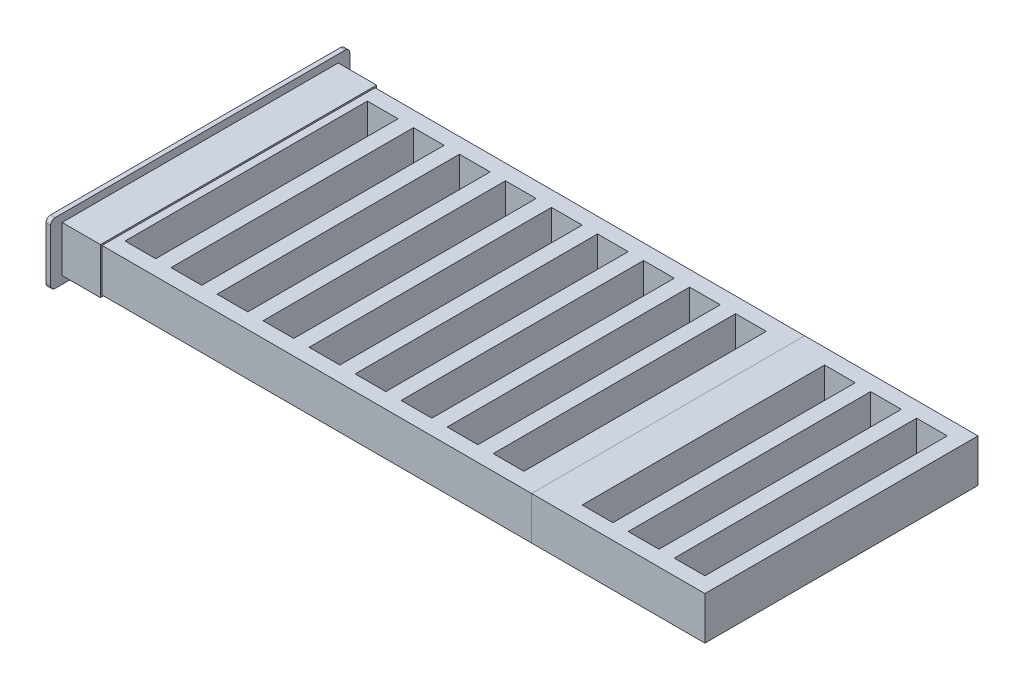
ISO-10303-21;
HEADER;
FILE_DESCRIPTION(('STEP AP214'),'2;1');
FILE_NAME('part.step','',(''),(''),'','','');
FILE_SCHEMA(('AUTOMOTIVE_DESIGN { 1 0 10303 214 1 1 1 1 }'));
ENDSEC;
DATA;
#1=APPLICATION_CONTEXT('core data for automotive mechanical design processes');
#2=APPLICATION_PROTOCOL_DEFINITION('international standard','automotive_design',2000,#1);
#3=PRODUCT_CONTEXT('',#1,'mechanical');
#4=PRODUCT('Part','Part','',(#3));
#5=PRODUCT_RELATED_PRODUCT_CATEGORY('part','',(#4));
#6=PRODUCT_DEFINITION_FORMATION('','',#4);
#7=PRODUCT_DEFINITION_CONTEXT('part definition',#1,'design');
#8=PRODUCT_DEFINITION('design','',#6,#7);
#9=PRODUCT_DEFINITION_SHAPE('','',#8);
#10=(LENGTH_UNIT() NAMED_UNIT(*) SI_UNIT(.MILLI.,.METRE.));
#11=(NAMED_UNIT(*) PLANE_ANGLE_UNIT() SI_UNIT($,.RADIAN.));
#12=(NAMED_UNIT(*) SI_UNIT($,.STERADIAN.) SOLID_ANGLE_UNIT());
#13=UNCERTAINTY_MEASURE_WITH_UNIT(LENGTH_MEASURE(1.E-05),#10,'distance_accuracy_value','');
#14=(GEOMETRIC_REPRESENTATION_CONTEXT(3) GLOBAL_UNCERTAINTY_ASSIGNED_CONTEXT((#13)) GLOBAL_UNIT_ASSIGNED_CONTEXT((#10,
#11,#12)) REPRESENTATION_CONTEXT('',''));
#15=CARTESIAN_POINT('',(0.,0.,0.));
#16=DIRECTION('',(0.,0.,1.));
#17=DIRECTION('',(1.,0.,0.));
#18=AXIS2_PLACEMENT_3D('',#15,#16,#17);
#19=CARTESIAN_POINT('',(152.5,-224.838800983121,89.));
#20=DIRECTION('',(0.,0.,1.));
#21=DIRECTION('',(1.,0.,0.));
#22=AXIS2_PLACEMENT_3D('',#19,#20,#21);
#23=PLANE('',#22);
#24=DIRECTION('',(-1.,0.,0.));
#25=VECTOR('',#24,1.);
#26=CARTESIAN_POINT('',(152.5,-14.,89.));
#27=LINE('',#26,#25);
#28=CARTESIAN_POINT('',(265.5,-14.0000000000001,89.));
#29=VERTEX_POINT('',#28);
#30=CARTESIAN_POINT('',(152.5,-14.,89.));
#31=VERTEX_POINT('',#30);
#32=EDGE_CURVE('E12',#29,#31,#27,.T.);
#33=ORIENTED_EDGE('',*,*,#32,.F.);
#34=DIRECTION('',(0.,1.,0.));
#35=VECTOR('',#34,1.);
#36=CARTESIAN_POINT('',(265.5,-224.838800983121,89.));
#37=LINE('',#36,#35);
#38=CARTESIAN_POINT('',(265.5,14.,89.));
#39=VERTEX_POINT('',#38);
#40=EDGE_CURVE('E200',#29,#39,#37,.T.);
#41=ORIENTED_EDGE('',*,*,#40,.T.);
#42=DIRECTION('',(1.,0.,0.));
#43=VECTOR('',#42,1.);
#44=CARTESIAN_POINT('',(152.5,14.,89.));
#45=LINE('',#44,#43);
#46=CARTESIAN_POINT('',(152.5,14.,89.));
#47=VERTEX_POINT('',#46);
#48=EDGE_CURVE('E185',#47,#39,#45,.T.);
#49=ORIENTED_EDGE('',*,*,#48,.F.);
#50=DIRECTION('',(0.,1.,0.));
#51=VECTOR('',#50,1.);
#52=CARTESIAN_POINT('',(152.5,-224.838800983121,89.));
#53=LINE('',#52,#51);
#54=EDGE_CURVE('E194',#31,#47,#53,.T.);
#55=ORIENTED_EDGE('',*,*,#54,.F.);
#56=EDGE_LOOP('',(#33,#41,#49,#55));
#57=FACE_BOUND('',#56,.T.);
#58=ADVANCED_FACE('F42',(#57),#23,.T.);
#59=CARTESIAN_POINT('',(265.5,-224.838800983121,-88.9999999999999));
#60=DIRECTION('',(1.,0.,0.));
#61=DIRECTION('',(0.,1.,0.));
#62=AXIS2_PLACEMENT_3D('',#59,#60,#61);
#63=PLANE('',#62);
#64=DIRECTION('',(0.,0.,1.));
#65=VECTOR('',#64,1.);
#66=CARTESIAN_POINT('',(265.5,-14.,-88.9999999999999));
#67=LINE('',#66,#65);
#68=CARTESIAN_POINT('',(265.5,-14.,-88.9999999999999));
#69=VERTEX_POINT('',#68);
#70=EDGE_CURVE('E243',#69,#29,#67,.T.);
#71=ORIENTED_EDGE('',*,*,#70,.F.);
#72=DIRECTION('',(0.,1.,0.));
#73=VECTOR('',#72,1.);
#74=CARTESIAN_POINT('',(265.5,-224.838800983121,-88.9999999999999));
#75=LINE('',#74,#73);
#76=CARTESIAN_POINT('',(265.5,14.,-88.9999999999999));
#77=VERTEX_POINT('',#76);
#78=EDGE_CURVE('E197',#69,#77,#75,.T.);
#79=ORIENTED_EDGE('',*,*,#78,.T.);
#80=DIRECTION('',(0.,0.,-1.));
#81=VECTOR('',#80,1.);
#82=CARTESIAN_POINT('',(265.5,14.,-88.9999999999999));
#83=LINE('',#82,#81);
#84=EDGE_CURVE('E188',#39,#77,#83,.T.);
#85=ORIENTED_EDGE('',*,*,#84,.F.);
#86=ORIENTED_EDGE('',*,*,#40,.F.);
#87=EDGE_LOOP('',(#71,#79,#85,#86));
#88=FACE_BOUND('',#87,.T.);
#89=ADVANCED_FACE('F247',(#88),#63,.T.);
#90=CARTESIAN_POINT('',(152.5,-224.838800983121,-88.9999999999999));
#91=DIRECTION('',(0.,0.,-1.));
#92=DIRECTION('',(-1.,0.,0.));
#93=AXIS2_PLACEMENT_3D('',#90,#91,#92);
#94=PLANE('',#93);
#95=DIRECTION('',(1.,0.,0.));
#96=VECTOR('',#95,1.);
#97=CARTESIAN_POINT('',(152.5,-14.,-88.9999999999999));
#98=LINE('',#97,#96);
#99=CARTESIAN_POINT('',(152.5,-14.,-88.9999999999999));
#100=VERTEX_POINT('',#99);
#101=EDGE_CURVE('E61',#100,#69,#98,.T.);
#102=ORIENTED_EDGE('',*,*,#101,.F.);
#103=DIRECTION('',(0.,1.,0.));
#104=VECTOR('',#103,1.);
#105=CARTESIAN_POINT('',(152.5,-224.838800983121,-88.9999999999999));
#106=LINE('',#105,#104);
#107=CARTESIAN_POINT('',(152.5,14.,-88.9999999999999));
#108=VERTEX_POINT('',#107);
#109=EDGE_CURVE('E108',#100,#108,#106,.T.);
#110=ORIENTED_EDGE('',*,*,#109,.T.);
#111=DIRECTION('',(-1.,0.,0.));
#112=VECTOR('',#111,1.);
#113=CARTESIAN_POINT('',(152.5,14.,-88.9999999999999));
#114=LINE('',#113,#112);
#115=EDGE_CURVE('E191',#77,#108,#114,.T.);
#116=ORIENTED_EDGE('',*,*,#115,.F.);
#117=ORIENTED_EDGE('',*,*,#78,.F.);
#118=EDGE_LOOP('',(#102,#110,#116,#117));
#119=FACE_BOUND('',#118,.T.);
#120=ADVANCED_FACE('F227',(#119),#94,.T.);
#121=CARTESIAN_POINT('',(152.5,-224.838800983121,-88.9999999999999));
#122=DIRECTION('',(-1.,0.,0.));
#123=DIRECTION('',(0.,-1.,0.));
#124=AXIS2_PLACEMENT_3D('',#121,#122,#123);
#125=PLANE('',#124);
#126=DIRECTION('',(0.,0.,-1.));
#127=VECTOR('',#126,1.);
#128=CARTESIAN_POINT('',(152.5,-14.,-88.9999999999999));
#129=LINE('',#128,#127);
#130=EDGE_CURVE('E211',#31,#100,#129,.T.);
#131=ORIENTED_EDGE('',*,*,#130,.F.);
#132=ORIENTED_EDGE('',*,*,#54,.T.);
#133=DIRECTION('',(0.,0.,1.));
#134=VECTOR('',#133,1.);
#135=CARTESIAN_POINT('',(152.5,14.,-88.9999999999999));
#136=LINE('',#135,#134);
#137=EDGE_CURVE('E174',#108,#47,#136,.T.);
#138=ORIENTED_EDGE('',*,*,#137,.F.);
#139=ORIENTED_EDGE('',*,*,#109,.F.);
#140=EDGE_LOOP('',(#131,#132,#138,#139));
#141=FACE_BOUND('',#140,.T.);
#142=ADVANCED_FACE('F44',(#141),#125,.T.);
#143=CARTESIAN_POINT('',(255.5,-224.838800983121,-79.));
#144=DIRECTION('',(0.,0.,-1.));
#145=DIRECTION('',(-1.,0.,0.));
#146=AXIS2_PLACEMENT_3D('',#143,#144,#145);
#147=PLANE('',#146);
#148=DIRECTION('',(0.,1.,0.));
#149=VECTOR('',#148,1.);
#150=CARTESIAN_POINT('',(235.5,-224.838800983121,-79.));
#151=LINE('',#150,#149);
#152=CARTESIAN_POINT('',(235.5,-14.,-79.));
#153=VERTEX_POINT('',#152);
#154=CARTESIAN_POINT('',(235.5,14.,-79.));
#155=VERTEX_POINT('',#154);
#156=EDGE_CURVE('E178',#153,#155,#151,.T.);
#157=ORIENTED_EDGE('',*,*,#156,.F.);
#158=DIRECTION('',(1.,0.,0.));
#159=VECTOR('',#158,1.);
#160=CARTESIAN_POINT('',(255.5,-14.,-79.));
#161=LINE('',#160,#159);
#162=CARTESIAN_POINT('',(255.5,-14.0000000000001,-79.));
#163=VERTEX_POINT('',#162);
#164=EDGE_CURVE('E245',#153,#163,#161,.T.);
#165=ORIENTED_EDGE('',*,*,#164,.T.);
#166=DIRECTION('',(0.,1.,0.));
#167=VECTOR('',#166,1.);
#168=CARTESIAN_POINT('',(255.5,-224.838800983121,-79.));
#169=LINE('',#168,#167);
#170=CARTESIAN_POINT('',(255.5,14.,-79.));
#171=VERTEX_POINT('',#170);
#172=EDGE_CURVE('E170',#163,#171,#169,.T.);
#173=ORIENTED_EDGE('',*,*,#172,.T.);
#174=DIRECTION('',(-1.,0.,0.));
#175=VECTOR('',#174,1.);
#176=CARTESIAN_POINT('',(255.5,14.,-79.));
#177=LINE('',#176,#175);
#178=EDGE_CURVE('E161',#171,#155,#177,.T.);
#179=ORIENTED_EDGE('',*,*,#178,.T.);
#180=EDGE_LOOP('',(#157,#165,#173,#179));
#181=FACE_BOUND('',#180,.T.);
#182=ADVANCED_FACE('F266',(#181),#147,.F.);
#183=CARTESIAN_POINT('',(235.5,-224.838800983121,-79.));
#184=DIRECTION('',(-1.,0.,0.));
#185=DIRECTION('',(0.,-1.,0.));
#186=AXIS2_PLACEMENT_3D('',#183,#184,#185);
#187=PLANE('',#186);
#188=DIRECTION('',(0.,1.,0.));
#189=VECTOR('',#188,1.);
#190=CARTESIAN_POINT('',(235.5,-224.838800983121,79.));
#191=LINE('',#190,#189);
#192=CARTESIAN_POINT('',(235.5,-14.,79.));
#193=VERTEX_POINT('',#192);
#194=CARTESIAN_POINT('',(235.5,14.,79.));
#195=VERTEX_POINT('',#194);
#196=EDGE_CURVE('E175',#193,#195,#191,.T.);
#197=ORIENTED_EDGE('',*,*,#196,.F.);
#198=DIRECTION('',(0.,0.,-1.));
#199=VECTOR('',#198,1.);
#200=CARTESIAN_POINT('',(235.5,-14.,-79.));
#201=LINE('',#200,#199);
#202=EDGE_CURVE('E52',#193,#153,#201,.T.);
#203=ORIENTED_EDGE('',*,*,#202,.T.);
#204=ORIENTED_EDGE('',*,*,#156,.T.);
#205=DIRECTION('',(0.,0.,1.));
#206=VECTOR('',#205,1.);
#207=CARTESIAN_POINT('',(235.5,14.,-79.));
#208=LINE('',#207,#206);
#209=EDGE_CURVE('E164',#155,#195,#208,.T.);
#210=ORIENTED_EDGE('',*,*,#209,.T.);
#211=EDGE_LOOP('',(#197,#203,#204,#210));
#212=FACE_BOUND('',#211,.T.);
#213=ADVANCED_FACE('F269',(#212),#187,.F.);
#214=CARTESIAN_POINT('',(255.5,-224.838800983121,79.));
#215=DIRECTION('',(0.,0.,1.));
#216=DIRECTION('',(1.,0.,0.));
#217=AXIS2_PLACEMENT_3D('',#214,#215,#216);
#218=PLANE('',#217);
#219=DIRECTION('',(0.,1.,0.));
#220=VECTOR('',#219,1.);
#221=CARTESIAN_POINT('',(255.5,-224.838800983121,79.));
#222=LINE('',#221,#220);
#223=CARTESIAN_POINT('',(255.5,-14.,79.));
#224=VERTEX_POINT('',#223);
#225=CARTESIAN_POINT('',(255.5,14.,79.));
#226=VERTEX_POINT('',#225);
#227=EDGE_CURVE('E171',#224,#226,#222,.T.);
#228=ORIENTED_EDGE('',*,*,#227,.F.);
#229=DIRECTION('',(-1.,0.,0.));
#230=VECTOR('',#229,1.);
#231=CARTESIAN_POINT('',(255.5,-14.,79.));
#232=LINE('',#231,#230);
#233=EDGE_CURVE('E437',#224,#193,#232,.T.);
#234=ORIENTED_EDGE('',*,*,#233,.T.);
#235=ORIENTED_EDGE('',*,*,#196,.T.);
#236=DIRECTION('',(1.,0.,0.));
#237=VECTOR('',#236,1.);
#238=CARTESIAN_POINT('',(255.5,14.,79.));
#239=LINE('',#238,#237);
#240=EDGE_CURVE('E167',#195,#226,#239,.T.);
#241=ORIENTED_EDGE('',*,*,#240,.T.);
#242=EDGE_LOOP('',(#228,#234,#235,#241));
#243=FACE_BOUND('',#242,.T.);
#244=ADVANCED_FACE('F264',(#243),#218,.F.);
#245=CARTESIAN_POINT('',(255.5,-224.838800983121,-79.));
#246=DIRECTION('',(1.,0.,0.));
#247=DIRECTION('',(0.,1.,0.));
#248=AXIS2_PLACEMENT_3D('',#245,#246,#247);
#249=PLANE('',#248);
#250=ORIENTED_EDGE('',*,*,#172,.F.);
#251=DIRECTION('',(0.,0.,1.));
#252=VECTOR('',#251,1.);
#253=CARTESIAN_POINT('',(255.5,-14.,-79.));
#254=LINE('',#253,#252);
#255=EDGE_CURVE('E427',#163,#224,#254,.T.);
#256=ORIENTED_EDGE('',*,*,#255,.T.);
#257=ORIENTED_EDGE('',*,*,#227,.T.);
#258=DIRECTION('',(0.,0.,-1.));
#259=VECTOR('',#258,1.);
#260=CARTESIAN_POINT('',(255.5,14.,-79.));
#261=LINE('',#260,#259);
#262=EDGE_CURVE('E150',#226,#171,#261,.T.);
#263=ORIENTED_EDGE('',*,*,#262,.T.);
#264=EDGE_LOOP('',(#250,#256,#257,#263));
#265=FACE_BOUND('',#264,.T.);
#266=ADVANCED_FACE('F260',(#265),#249,.F.);
#267=CARTESIAN_POINT('',(225.5,-224.838800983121,-79.));
#268=DIRECTION('',(0.,0.,-1.));
#269=DIRECTION('',(-1.,0.,0.));
#270=AXIS2_PLACEMENT_3D('',#267,#268,#269);
#271=PLANE('',#270);
#272=DIRECTION('',(0.,1.,0.));
#273=VECTOR('',#272,1.);
#274=CARTESIAN_POINT('',(205.5,-224.838800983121,-79.));
#275=LINE('',#274,#273);
#276=CARTESIAN_POINT('',(205.5,-14.,-79.));
#277=VERTEX_POINT('',#276);
#278=CARTESIAN_POINT('',(205.5,14.,-79.));
#279=VERTEX_POINT('',#278);
#280=EDGE_CURVE('E154',#277,#279,#275,.T.);
#281=ORIENTED_EDGE('',*,*,#280,.F.);
#282=DIRECTION('',(1.,0.,0.));
#283=VECTOR('',#282,1.);
#284=CARTESIAN_POINT('',(225.5,-14.,-79.));
#285=LINE('',#284,#283);
#286=CARTESIAN_POINT('',(225.5,-14.0000000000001,-79.));
#287=VERTEX_POINT('',#286);
#288=EDGE_CURVE('E107',#277,#287,#285,.T.);
#289=ORIENTED_EDGE('',*,*,#288,.T.);
#290=DIRECTION('',(0.,1.,0.));
#291=VECTOR('',#290,1.);
#292=CARTESIAN_POINT('',(225.5,-224.838800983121,-79.));
#293=LINE('',#292,#291);
#294=CARTESIAN_POINT('',(225.5,14.,-79.));
#295=VERTEX_POINT('',#294);
#296=EDGE_CURVE('E146',#287,#295,#293,.T.);
#297=ORIENTED_EDGE('',*,*,#296,.T.);
#298=DIRECTION('',(-1.,0.,0.));
#299=VECTOR('',#298,1.);
#300=CARTESIAN_POINT('',(225.5,14.,-79.));
#301=LINE('',#300,#299);
#302=EDGE_CURVE('E137',#295,#279,#301,.T.);
#303=ORIENTED_EDGE('',*,*,#302,.T.);
#304=EDGE_LOOP('',(#281,#289,#297,#303));
#305=FACE_BOUND('',#304,.T.);
#306=ADVANCED_FACE('F263',(#305),#271,.F.);
#307=CARTESIAN_POINT('',(205.5,-224.838800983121,-79.));
#308=DIRECTION('',(-1.,0.,0.));
#309=DIRECTION('',(0.,-1.,0.));
#310=AXIS2_PLACEMENT_3D('',#307,#308,#309);
#311=PLANE('',#310);
#312=DIRECTION('',(0.,1.,0.));
#313=VECTOR('',#312,1.);
#314=CARTESIAN_POINT('',(205.5,-224.838800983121,79.));
#315=LINE('',#314,#313);
#316=CARTESIAN_POINT('',(205.5,-14.,79.));
#317=VERTEX_POINT('',#316);
#318=CARTESIAN_POINT('',(205.5,14.,79.));
#319=VERTEX_POINT('',#318);
#320=EDGE_CURVE('E151',#317,#319,#315,.T.);
#321=ORIENTED_EDGE('',*,*,#320,.F.);
#322=DIRECTION('',(0.,0.,-1.));
#323=VECTOR('',#322,1.);
#324=CARTESIAN_POINT('',(205.5,-14.,-79.));
#325=LINE('',#324,#323);
#326=EDGE_CURVE('E424',#317,#277,#325,.T.);
#327=ORIENTED_EDGE('',*,*,#326,.T.);
#328=ORIENTED_EDGE('',*,*,#280,.T.);
#329=DIRECTION('',(0.,0.,1.));
#330=VECTOR('',#329,1.);
#331=CARTESIAN_POINT('',(205.5,14.,-79.));
#332=LINE('',#331,#330);
#333=EDGE_CURVE('E140',#279,#319,#332,.T.);
#334=ORIENTED_EDGE('',*,*,#333,.T.);
#335=EDGE_LOOP('',(#321,#327,#328,#334));
#336=FACE_BOUND('',#335,.T.);
#337=ADVANCED_FACE('F283',(#336),#311,.F.);
#338=CARTESIAN_POINT('',(225.5,-224.838800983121,79.));
#339=DIRECTION('',(0.,0.,1.));
#340=DIRECTION('',(1.,0.,0.));
#341=AXIS2_PLACEMENT_3D('',#338,#339,#340);
#342=PLANE('',#341);
#343=DIRECTION('',(0.,1.,0.));
#344=VECTOR('',#343,1.);
#345=CARTESIAN_POINT('',(225.5,-224.838800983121,79.));
#346=LINE('',#345,#344);
#347=CARTESIAN_POINT('',(225.5,-14.,79.));
#348=VERTEX_POINT('',#347);
#349=CARTESIAN_POINT('',(225.5,14.,79.));
#350=VERTEX_POINT('',#349);
#351=EDGE_CURVE('E147',#348,#350,#346,.T.);
#352=ORIENTED_EDGE('',*,*,#351,.F.);
#353=DIRECTION('',(-1.,0.,0.));
#354=VECTOR('',#353,1.);
#355=CARTESIAN_POINT('',(225.5,-14.,79.));
#356=LINE('',#355,#354);
#357=EDGE_CURVE('E428',#348,#317,#356,.T.);
#358=ORIENTED_EDGE('',*,*,#357,.T.);
#359=ORIENTED_EDGE('',*,*,#320,.T.);
#360=DIRECTION('',(1.,0.,0.));
#361=VECTOR('',#360,1.);
#362=CARTESIAN_POINT('',(225.5,14.,79.));
#363=LINE('',#362,#361);
#364=EDGE_CURVE('E143',#319,#350,#363,.T.);
#365=ORIENTED_EDGE('',*,*,#364,.T.);
#366=EDGE_LOOP('',(#352,#358,#359,#365));
#367=FACE_BOUND('',#366,.T.);
#368=ADVANCED_FACE('F279',(#367),#342,.F.);
#369=CARTESIAN_POINT('',(225.5,-224.838800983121,-79.));
#370=DIRECTION('',(1.,0.,0.));
#371=DIRECTION('',(0.,1.,0.));
#372=AXIS2_PLACEMENT_3D('',#369,#370,#371);
#373=PLANE('',#372);
#374=ORIENTED_EDGE('',*,*,#296,.F.);
#375=DIRECTION('',(0.,0.,1.));
#376=VECTOR('',#375,1.);
#377=CARTESIAN_POINT('',(225.5,-14.,-79.));
#378=LINE('',#377,#376);
#379=EDGE_CURVE('E119',#287,#348,#378,.T.);
#380=ORIENTED_EDGE('',*,*,#379,.T.);
#381=ORIENTED_EDGE('',*,*,#351,.T.);
#382=DIRECTION('',(0.,0.,-1.));
#383=VECTOR('',#382,1.);
#384=CARTESIAN_POINT('',(225.5,14.,-79.));
#385=LINE('',#384,#383);
#386=EDGE_CURVE('E134',#350,#295,#385,.T.);
#387=ORIENTED_EDGE('',*,*,#386,.T.);
#388=EDGE_LOOP('',(#374,#380,#381,#387));
#389=FACE_BOUND('',#388,.T.);
#390=ADVANCED_FACE('F258',(#389),#373,.F.);
#391=CARTESIAN_POINT('',(152.5,14.,89.));
#392=DIRECTION('',(0.,1.,0.));
#393=DIRECTION('',(0.,0.,1.));
#394=AXIS2_PLACEMENT_3D('',#391,#392,#393);
#395=PLANE('',#394);
#396=DIRECTION('',(0.,0.,-1.));
#397=VECTOR('',#396,1.);
#398=CARTESIAN_POINT('',(195.5,14.,-79.));
#399=LINE('',#398,#397);
#400=CARTESIAN_POINT('',(195.5,14.,79.));
#401=VERTEX_POINT('',#400);
#402=CARTESIAN_POINT('',(195.5,14.,-79.));
#403=VERTEX_POINT('',#402);
#404=EDGE_CURVE('E443',#401,#403,#399,.T.);
#405=ORIENTED_EDGE('',*,*,#404,.F.);
#406=DIRECTION('',(1.,0.,0.));
#407=VECTOR('',#406,1.);
#408=CARTESIAN_POINT('',(195.5,14.,79.));
#409=LINE('',#408,#407);
#410=CARTESIAN_POINT('',(175.5,14.,79.));
#411=VERTEX_POINT('',#410);
#412=EDGE_CURVE('E130',#411,#401,#409,.T.);
#413=ORIENTED_EDGE('',*,*,#412,.F.);
#414=DIRECTION('',(0.,0.,1.));
#415=VECTOR('',#414,1.);
#416=CARTESIAN_POINT('',(175.5,14.,-79.));
#417=LINE('',#416,#415);
#418=CARTESIAN_POINT('',(175.5,14.,-79.));
#419=VERTEX_POINT('',#418);
#420=EDGE_CURVE('E446',#419,#411,#417,.T.);
#421=ORIENTED_EDGE('',*,*,#420,.F.);
#422=DIRECTION('',(-1.,0.,0.));
#423=VECTOR('',#422,1.);
#424=CARTESIAN_POINT('',(195.5,14.,-79.));
#425=LINE('',#424,#423);
#426=EDGE_CURVE('E124',#403,#419,#425,.T.);
#427=ORIENTED_EDGE('',*,*,#426,.F.);
#428=EDGE_LOOP('',(#405,#413,#421,#427));
#429=FACE_BOUND('',#428,.T.);
#430=ORIENTED_EDGE('',*,*,#386,.F.);
#431=ORIENTED_EDGE('',*,*,#364,.F.);
#432=ORIENTED_EDGE('',*,*,#333,.F.);
#433=ORIENTED_EDGE('',*,*,#302,.F.);
#434=EDGE_LOOP('',(#430,#431,#432,#433));
#435=FACE_BOUND('',#434,.T.);
#436=ORIENTED_EDGE('',*,*,#262,.F.);
#437=ORIENTED_EDGE('',*,*,#240,.F.);
#438=ORIENTED_EDGE('',*,*,#209,.F.);
#439=ORIENTED_EDGE('',*,*,#178,.F.);
#440=EDGE_LOOP('',(#436,#437,#438,#439));
#441=FACE_BOUND('',#440,.T.);
#442=ORIENTED_EDGE('',*,*,#137,.T.);
#443=ORIENTED_EDGE('',*,*,#48,.T.);
#444=ORIENTED_EDGE('',*,*,#84,.T.);
#445=ORIENTED_EDGE('',*,*,#115,.T.);
#446=EDGE_LOOP('',(#442,#443,#444,#445));
#447=FACE_BOUND('',#446,.T.);
#448=ADVANCED_FACE('F220',(#429,#435,#441,#447),#395,.T.);
#449=CARTESIAN_POINT('',(195.5,-224.838800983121,-79.));
#450=DIRECTION('',(0.,0.,-1.));
#451=DIRECTION('',(-1.,0.,0.));
#452=AXIS2_PLACEMENT_3D('',#449,#450,#451);
#453=PLANE('',#452);
#454=DIRECTION('',(0.,1.,0.));
#455=VECTOR('',#454,1.);
#456=CARTESIAN_POINT('',(175.5,-224.838800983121,-79.));
#457=LINE('',#456,#455);
#458=CARTESIAN_POINT('',(175.5,-14.,-79.));
#459=VERTEX_POINT('',#458);
#460=EDGE_CURVE('E114',#459,#419,#457,.T.);
#461=ORIENTED_EDGE('',*,*,#460,.F.);
#462=DIRECTION('',(1.,0.,0.));
#463=VECTOR('',#462,1.);
#464=CARTESIAN_POINT('',(195.5,-14.,-79.));
#465=LINE('',#464,#463);
#466=CARTESIAN_POINT('',(195.5,-14.0000000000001,-79.));
#467=VERTEX_POINT('',#466);
#468=EDGE_CURVE('E46',#459,#467,#465,.T.);
#469=ORIENTED_EDGE('',*,*,#468,.T.);
#470=DIRECTION('',(0.,1.,0.));
#471=VECTOR('',#470,1.);
#472=CARTESIAN_POINT('',(195.5,-224.838800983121,-79.));
#473=LINE('',#472,#471);
#474=EDGE_CURVE('E126',#467,#403,#473,.T.);
#475=ORIENTED_EDGE('',*,*,#474,.T.);
#476=ORIENTED_EDGE('',*,*,#426,.T.);
#477=EDGE_LOOP('',(#461,#469,#475,#476));
#478=FACE_BOUND('',#477,.T.);
#479=ADVANCED_FACE('F122',(#478),#453,.F.);
#480=CARTESIAN_POINT('',(175.5,-224.838800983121,-79.));
#481=DIRECTION('',(-1.,0.,0.));
#482=DIRECTION('',(0.,-1.,0.));
#483=AXIS2_PLACEMENT_3D('',#480,#481,#482);
#484=PLANE('',#483);
#485=DIRECTION('',(0.,1.,0.));
#486=VECTOR('',#485,1.);
#487=CARTESIAN_POINT('',(175.5,-224.838800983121,79.));
#488=LINE('',#487,#486);
#489=CARTESIAN_POINT('',(175.5,-14.,79.));
#490=VERTEX_POINT('',#489);
#491=EDGE_CURVE('E117',#490,#411,#488,.T.);
#492=ORIENTED_EDGE('',*,*,#491,.F.);
#493=DIRECTION('',(0.,0.,-1.));
#494=VECTOR('',#493,1.);
#495=CARTESIAN_POINT('',(175.5,-14.,-79.));
#496=LINE('',#495,#494);
#497=EDGE_CURVE('E94',#490,#459,#496,.T.);
#498=ORIENTED_EDGE('',*,*,#497,.T.);
#499=ORIENTED_EDGE('',*,*,#460,.T.);
#500=ORIENTED_EDGE('',*,*,#420,.T.);
#501=EDGE_LOOP('',(#492,#498,#499,#500));
#502=FACE_BOUND('',#501,.T.);
#503=ADVANCED_FACE('F111',(#502),#484,.F.);
#504=CARTESIAN_POINT('',(195.5,-224.838800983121,79.));
#505=DIRECTION('',(0.,0.,1.));
#506=DIRECTION('',(1.,0.,0.));
#507=AXIS2_PLACEMENT_3D('',#504,#505,#506);
#508=PLANE('',#507);
#509=DIRECTION('',(0.,1.,0.));
#510=VECTOR('',#509,1.);
#511=CARTESIAN_POINT('',(195.5,-224.838800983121,79.));
#512=LINE('',#511,#510);
#513=CARTESIAN_POINT('',(195.5,-14.,79.));
#514=VERTEX_POINT('',#513);
#515=EDGE_CURVE('E128',#514,#401,#512,.T.);
#516=ORIENTED_EDGE('',*,*,#515,.F.);
#517=DIRECTION('',(-1.,0.,0.));
#518=VECTOR('',#517,1.);
#519=CARTESIAN_POINT('',(195.5,-14.,79.));
#520=LINE('',#519,#518);
#521=EDGE_CURVE('E120',#514,#490,#520,.T.);
#522=ORIENTED_EDGE('',*,*,#521,.T.);
#523=ORIENTED_EDGE('',*,*,#491,.T.);
#524=ORIENTED_EDGE('',*,*,#412,.T.);
#525=EDGE_LOOP('',(#516,#522,#523,#524));
#526=FACE_BOUND('',#525,.T.);
#527=ADVANCED_FACE('F294',(#526),#508,.F.);
#528=CARTESIAN_POINT('',(195.5,-224.838800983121,-79.));
#529=DIRECTION('',(1.,0.,0.));
#530=DIRECTION('',(0.,1.,0.));
#531=AXIS2_PLACEMENT_3D('',#528,#529,#530);
#532=PLANE('',#531);
#533=ORIENTED_EDGE('',*,*,#474,.F.);
#534=DIRECTION('',(0.,0.,1.));
#535=VECTOR('',#534,1.);
#536=CARTESIAN_POINT('',(195.5,-14.,-79.));
#537=LINE('',#536,#535);
#538=EDGE_CURVE('E102',#467,#514,#537,.T.);
#539=ORIENTED_EDGE('',*,*,#538,.T.);
#540=ORIENTED_EDGE('',*,*,#515,.T.);
#541=ORIENTED_EDGE('',*,*,#404,.T.);
#542=EDGE_LOOP('',(#533,#539,#540,#541));
#543=FACE_BOUND('',#542,.T.);
#544=ADVANCED_FACE('F291',(#543),#532,.F.);
#545=CARTESIAN_POINT('',(-152.5,-14.,89.));
#546=DIRECTION('',(0.,1.,0.));
#547=DIRECTION('',(0.,0.,1.));
#548=AXIS2_PLACEMENT_3D('',#545,#546,#547);
#549=PLANE('',#548);
#550=ORIENTED_EDGE('',*,*,#130,.T.);
#551=ORIENTED_EDGE('',*,*,#101,.T.);
#552=ORIENTED_EDGE('',*,*,#70,.T.);
#553=ORIENTED_EDGE('',*,*,#32,.T.);
#554=EDGE_LOOP('',(#550,#551,#552,#553));
#555=FACE_BOUND('',#554,.T.);
#556=ORIENTED_EDGE('',*,*,#288,.F.);
#557=ORIENTED_EDGE('',*,*,#326,.F.);
#558=ORIENTED_EDGE('',*,*,#357,.F.);
#559=ORIENTED_EDGE('',*,*,#379,.F.);
#560=EDGE_LOOP('',(#556,#557,#558,#559));
#561=FACE_BOUND('',#560,.T.);
#562=ORIENTED_EDGE('',*,*,#468,.F.);
#563=ORIENTED_EDGE('',*,*,#497,.F.);
#564=ORIENTED_EDGE('',*,*,#521,.F.);
#565=ORIENTED_EDGE('',*,*,#538,.F.);
#566=EDGE_LOOP('',(#562,#563,#564,#565));
#567=FACE_BOUND('',#566,.T.);
#568=ORIENTED_EDGE('',*,*,#164,.F.);
#569=ORIENTED_EDGE('',*,*,#202,.F.);
#570=ORIENTED_EDGE('',*,*,#233,.F.);
#571=ORIENTED_EDGE('',*,*,#255,.F.);
#572=EDGE_LOOP('',(#568,#569,#570,#571));
#573=FACE_BOUND('',#572,.T.);
#574=ADVANCED_FACE('F98',(#555,#561,#567,#573),#549,.F.);
#575=CLOSED_SHELL('',(#58,#89,#120,#142,#182,#213,#244,#266,#306,#337,#368,#390,#448,#479,#503,
#527,#544,#574));
#576=MANIFOLD_SOLID_BREP('B2',#575);
#577=CARTESIAN_POINT('',(-155.5,20.,-97.5));
#578=DIRECTION('',(0.,0.,1.));
#579=DIRECTION('',(1.,0.,0.));
#580=AXIS2_PLACEMENT_3D('',#577,#578,#579);
#581=PLANE('',#580);
#582=DIRECTION('',(0.,-1.,0.));
#583=VECTOR('',#582,1.);
#584=CARTESIAN_POINT('',(-152.5,20.,-97.5));
#585=LINE('',#584,#583);
#586=CARTESIAN_POINT('',(-152.5,17.,-97.5));
#587=VERTEX_POINT('',#586);
#588=CARTESIAN_POINT('',(-152.5,-17.,-97.5));
#589=VERTEX_POINT('',#588);
#590=EDGE_CURVE('E917',#587,#589,#585,.T.);
#591=ORIENTED_EDGE('',*,*,#590,.T.);
#592=DIRECTION('',(1.,0.,0.));
#593=VECTOR('',#592,1.);
#594=CARTESIAN_POINT('',(-155.5,-17.,-97.5));
#595=LINE('',#594,#593);
#596=CARTESIAN_POINT('',(-155.5,-17.,-97.5));
#597=VERTEX_POINT('',#596);
#598=EDGE_CURVE('E990',#589,#597,#595,.F.);
#599=ORIENTED_EDGE('',*,*,#598,.T.);
#600=DIRECTION('',(0.,-1.,0.));
#601=VECTOR('',#600,1.);
#602=CARTESIAN_POINT('',(-155.5,20.,-97.5));
#603=LINE('',#602,#601);
#604=CARTESIAN_POINT('',(-155.5,17.,-97.5));
#605=VERTEX_POINT('',#604);
#606=EDGE_CURVE('E929',#605,#597,#603,.T.);
#607=ORIENTED_EDGE('',*,*,#606,.F.);
#608=DIRECTION('',(1.,0.,0.));
#609=VECTOR('',#608,1.);
#610=CARTESIAN_POINT('',(-155.5,17.,-97.5));
#611=LINE('',#610,#609);
#612=EDGE_CURVE('E987',#605,#587,#611,.T.);
#613=ORIENTED_EDGE('',*,*,#612,.T.);
#614=EDGE_LOOP('',(#591,#599,#607,#613));
#615=FACE_BOUND('',#614,.T.);
#616=ADVANCED_FACE('F483',(#615),#581,.F.);
#617=CARTESIAN_POINT('',(-155.5,-20.,-97.5));
#618=DIRECTION('',(0.,1.,0.));
#619=DIRECTION('',(0.,0.,1.));
#620=AXIS2_PLACEMENT_3D('',#617,#618,#619);
#621=PLANE('',#620);
#622=DIRECTION('',(0.,0.,1.));
#623=VECTOR('',#622,1.);
#624=CARTESIAN_POINT('',(-152.5,-20.,-97.5));
#625=LINE('',#624,#623);
#626=CARTESIAN_POINT('',(-152.5,-20.,-94.5));
#627=VERTEX_POINT('',#626);
#628=CARTESIAN_POINT('',(-152.5,-20.,94.5));
#629=VERTEX_POINT('',#628);
#630=EDGE_CURVE('E920',#627,#629,#625,.T.);
#631=ORIENTED_EDGE('',*,*,#630,.T.);
#632=DIRECTION('',(1.,0.,0.));
#633=VECTOR('',#632,1.);
#634=CARTESIAN_POINT('',(-155.5,-20.,94.5));
#635=LINE('',#634,#633);
#636=CARTESIAN_POINT('',(-155.5,-20.,94.5));
#637=VERTEX_POINT('',#636);
#638=EDGE_CURVE('E977',#629,#637,#635,.F.);
#639=ORIENTED_EDGE('',*,*,#638,.T.);
#640=DIRECTION('',(0.,0.,1.));
#641=VECTOR('',#640,1.);
#642=CARTESIAN_POINT('',(-155.5,-20.,-97.5));
#643=LINE('',#642,#641);
#644=CARTESIAN_POINT('',(-155.5,-20.,-94.5));
#645=VERTEX_POINT('',#644);
#646=EDGE_CURVE('E932',#645,#637,#643,.T.);
#647=ORIENTED_EDGE('',*,*,#646,.F.);
#648=DIRECTION('',(1.,0.,0.));
#649=VECTOR('',#648,1.);
#650=CARTESIAN_POINT('',(-155.5,-20.,-94.5));
#651=LINE('',#650,#649);
#652=EDGE_CURVE('E974',#645,#627,#651,.T.);
#653=ORIENTED_EDGE('',*,*,#652,.T.);
#654=EDGE_LOOP('',(#631,#639,#647,#653));
#655=FACE_BOUND('',#654,.T.);
#656=ADVANCED_FACE('F1253',(#655),#621,.F.);
#657=CARTESIAN_POINT('',(-155.5,20.,97.5));
#658=DIRECTION('',(0.,0.,-1.));
#659=DIRECTION('',(-1.,0.,0.));
#660=AXIS2_PLACEMENT_3D('',#657,#658,#659);
#661=PLANE('',#660);
#662=DIRECTION('',(0.,1.,0.));
#663=VECTOR('',#662,1.);
#664=CARTESIAN_POINT('',(-155.5,20.,97.5));
#665=LINE('',#664,#663);
#666=CARTESIAN_POINT('',(-155.5,-17.,97.5));
#667=VERTEX_POINT('',#666);
#668=CARTESIAN_POINT('',(-155.5,17.,97.5));
#669=VERTEX_POINT('',#668);
#670=EDGE_CURVE('E935',#667,#669,#665,.T.);
#671=ORIENTED_EDGE('',*,*,#670,.F.);
#672=DIRECTION('',(1.,0.,0.));
#673=VECTOR('',#672,1.);
#674=CARTESIAN_POINT('',(-155.5,-17.,97.5));
#675=LINE('',#674,#673);
#676=CARTESIAN_POINT('',(-152.5,-17.,97.5));
#677=VERTEX_POINT('',#676);
#678=EDGE_CURVE('E963',#667,#677,#675,.T.);
#679=ORIENTED_EDGE('',*,*,#678,.T.);
#680=DIRECTION('',(0.,1.,0.));
#681=VECTOR('',#680,1.);
#682=CARTESIAN_POINT('',(-152.5,20.,97.5));
#683=LINE('',#682,#681);
#684=CARTESIAN_POINT('',(-152.5,17.,97.5));
#685=VERTEX_POINT('',#684);
#686=EDGE_CURVE('E923',#677,#685,#683,.T.);
#687=ORIENTED_EDGE('',*,*,#686,.T.);
#688=DIRECTION('',(1.,0.,0.));
#689=VECTOR('',#688,1.);
#690=CARTESIAN_POINT('',(-155.5,17.,97.5));
#691=LINE('',#690,#689);
#692=EDGE_CURVE('E961',#685,#669,#691,.F.);
#693=ORIENTED_EDGE('',*,*,#692,.T.);
#694=EDGE_LOOP('',(#671,#679,#687,#693));
#695=FACE_BOUND('',#694,.T.);
#696=ADVANCED_FACE('F1259',(#695),#661,.F.);
#697=CARTESIAN_POINT('',(-155.5,20.,-97.5));
#698=DIRECTION('',(0.,-1.,0.));
#699=DIRECTION('',(0.,0.,-1.));
#700=AXIS2_PLACEMENT_3D('',#697,#698,#699);
#701=PLANE('',#700);
#702=DIRECTION('',(0.,0.,-1.));
#703=VECTOR('',#702,1.);
#704=CARTESIAN_POINT('',(-152.5,20.,-97.5));
#705=LINE('',#704,#703);
#706=CARTESIAN_POINT('',(-152.5,20.,94.5));
#707=VERTEX_POINT('',#706);
#708=CARTESIAN_POINT('',(-152.5,20.,-94.5));
#709=VERTEX_POINT('',#708);
#710=EDGE_CURVE('E926',#707,#709,#705,.T.);
#711=ORIENTED_EDGE('',*,*,#710,.T.);
#712=DIRECTION('',(1.,0.,0.));
#713=VECTOR('',#712,1.);
#714=CARTESIAN_POINT('',(-155.5,20.,-94.5));
#715=LINE('',#714,#713);
#716=CARTESIAN_POINT('',(-155.5,20.,-94.5));
#717=VERTEX_POINT('',#716);
#718=EDGE_CURVE('E995',#709,#717,#715,.F.);
#719=ORIENTED_EDGE('',*,*,#718,.T.);
#720=DIRECTION('',(0.,0.,-1.));
#721=VECTOR('',#720,1.);
#722=CARTESIAN_POINT('',(-155.5,20.,-97.5));
#723=LINE('',#722,#721);
#724=CARTESIAN_POINT('',(-155.5,20.,94.5));
#725=VERTEX_POINT('',#724);
#726=EDGE_CURVE('E938',#725,#717,#723,.T.);
#727=ORIENTED_EDGE('',*,*,#726,.F.);
#728=DIRECTION('',(1.,0.,0.));
#729=VECTOR('',#728,1.);
#730=CARTESIAN_POINT('',(-155.5,20.,94.5));
#731=LINE('',#730,#729);
#732=EDGE_CURVE('E992',#725,#707,#731,.T.);
#733=ORIENTED_EDGE('',*,*,#732,.T.);
#734=EDGE_LOOP('',(#711,#719,#727,#733));
#735=FACE_BOUND('',#734,.T.);
#736=ADVANCED_FACE('F1265',(#735),#701,.F.);
#737=CARTESIAN_POINT('',(-155.5,-20.,-97.5));
#738=DIRECTION('',(-1.,0.,0.));
#739=DIRECTION('',(0.,0.,1.));
#740=AXIS2_PLACEMENT_3D('',#737,#738,#739);
#741=PLANE('',#740);
#742=ORIENTED_EDGE('',*,*,#646,.T.);
#743=CARTESIAN_POINT('',(-155.5,-17.,94.5));
#744=DIRECTION('',(-1.,0.,0.));
#745=DIRECTION('',(0.,0.,1.));
#746=AXIS2_PLACEMENT_3D('',#743,#744,#745);
#747=CIRCLE('',#746,3.);
#748=EDGE_CURVE('E985',#637,#667,#747,.T.);
#749=ORIENTED_EDGE('',*,*,#748,.T.);
#750=ORIENTED_EDGE('',*,*,#670,.T.);
#751=CARTESIAN_POINT('',(-155.5,17.,94.5));
#752=DIRECTION('',(-1.,0.,0.));
#753=DIRECTION('',(0.,0.,1.));
#754=AXIS2_PLACEMENT_3D('',#751,#752,#753);
#755=CIRCLE('',#754,3.);
#756=EDGE_CURVE('E979',#669,#725,#755,.T.);
#757=ORIENTED_EDGE('',*,*,#756,.T.);
#758=ORIENTED_EDGE('',*,*,#726,.T.);
#759=CARTESIAN_POINT('',(-155.5,17.,-94.5));
#760=DIRECTION('',(-1.,0.,0.));
#761=DIRECTION('',(0.,0.,1.));
#762=AXIS2_PLACEMENT_3D('',#759,#760,#761);
#763=CIRCLE('',#762,3.);
#764=EDGE_CURVE('E981',#717,#605,#763,.T.);
#765=ORIENTED_EDGE('',*,*,#764,.T.);
#766=ORIENTED_EDGE('',*,*,#606,.T.);
#767=CARTESIAN_POINT('',(-155.5,-17.,-94.5));
#768=DIRECTION('',(-1.,0.,0.));
#769=DIRECTION('',(0.,0.,1.));
#770=AXIS2_PLACEMENT_3D('',#767,#768,#769);
#771=CIRCLE('',#770,3.);
#772=EDGE_CURVE('E983',#597,#645,#771,.T.);
#773=ORIENTED_EDGE('',*,*,#772,.T.);
#774=EDGE_LOOP('',(#742,#749,#750,#757,#758,#765,#766,#773));
#775=FACE_BOUND('',#774,.T.);
#776=ADVANCED_FACE('F1269',(#775),#741,.T.);
#777=CARTESIAN_POINT('',(-152.5,-20.,-97.5));
#778=DIRECTION('',(-1.,0.,0.));
#779=DIRECTION('',(0.,0.,1.));
#780=AXIS2_PLACEMENT_3D('',#777,#778,#779);
#781=PLANE('',#780);
#782=DIRECTION('',(0.,1.,0.));
#783=VECTOR('',#782,1.);
#784=CARTESIAN_POINT('',(-152.5,-15.,-90.));
#785=LINE('',#784,#783);
#786=CARTESIAN_POINT('',(-152.5,-15.,-90.));
#787=VERTEX_POINT('',#786);
#788=CARTESIAN_POINT('',(-152.5,15.,-90.));
#789=VERTEX_POINT('',#788);
#790=EDGE_CURVE('E901',#787,#789,#785,.T.);
#791=ORIENTED_EDGE('',*,*,#790,.F.);
#792=DIRECTION('',(0.,0.,1.));
#793=VECTOR('',#792,1.);
#794=CARTESIAN_POINT('',(-152.5,-15.,90.));
#795=LINE('',#794,#793);
#796=CARTESIAN_POINT('',(-152.5,-15.,90.0000000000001));
#797=VERTEX_POINT('',#796);
#798=EDGE_CURVE('E889',#787,#797,#795,.T.);
#799=ORIENTED_EDGE('',*,*,#798,.T.);
#800=DIRECTION('',(0.,1.,0.));
#801=VECTOR('',#800,1.);
#802=CARTESIAN_POINT('',(-152.5,-15.,90.));
#803=LINE('',#802,#801);
#804=CARTESIAN_POINT('',(-152.5,15.,90.));
#805=VERTEX_POINT('',#804);
#806=EDGE_CURVE('E900',#797,#805,#803,.T.);
#807=ORIENTED_EDGE('',*,*,#806,.T.);
#808=DIRECTION('',(0.,0.,1.));
#809=VECTOR('',#808,1.);
#810=CARTESIAN_POINT('',(-152.5,15.,90.));
#811=LINE('',#810,#809);
#812=EDGE_CURVE('E877',#789,#805,#811,.T.);
#813=ORIENTED_EDGE('',*,*,#812,.F.);
#814=EDGE_LOOP('',(#791,#799,#807,#813));
#815=FACE_BOUND('',#814,.T.);
#816=ORIENTED_EDGE('',*,*,#686,.F.);
#817=CARTESIAN_POINT('',(-152.5,-17.,94.5));
#818=DIRECTION('',(-1.,0.,0.));
#819=DIRECTION('',(0.,0.,1.));
#820=AXIS2_PLACEMENT_3D('',#817,#818,#819);
#821=CIRCLE('',#820,3.);
#822=EDGE_CURVE('E972',#677,#629,#821,.F.);
#823=ORIENTED_EDGE('',*,*,#822,.T.);
#824=ORIENTED_EDGE('',*,*,#630,.F.);
#825=CARTESIAN_POINT('',(-152.5,-17.,-94.5));
#826=DIRECTION('',(-1.,0.,0.));
#827=DIRECTION('',(0.,0.,1.));
#828=AXIS2_PLACEMENT_3D('',#825,#826,#827);
#829=CIRCLE('',#828,3.);
#830=EDGE_CURVE('E970',#627,#589,#829,.F.);
#831=ORIENTED_EDGE('',*,*,#830,.T.);
#832=ORIENTED_EDGE('',*,*,#590,.F.);
#833=CARTESIAN_POINT('',(-152.5,17.,-94.5));
#834=DIRECTION('',(-1.,0.,0.));
#835=DIRECTION('',(0.,0.,1.));
#836=AXIS2_PLACEMENT_3D('',#833,#834,#835);
#837=CIRCLE('',#836,3.);
#838=EDGE_CURVE('E968',#587,#709,#837,.F.);
#839=ORIENTED_EDGE('',*,*,#838,.T.);
#840=ORIENTED_EDGE('',*,*,#710,.F.);
#841=CARTESIAN_POINT('',(-152.5,17.,94.5));
#842=DIRECTION('',(-1.,0.,0.));
#843=DIRECTION('',(0.,0.,1.));
#844=AXIS2_PLACEMENT_3D('',#841,#842,#843);
#845=CIRCLE('',#844,3.);
#846=EDGE_CURVE('E966',#707,#685,#845,.F.);
#847=ORIENTED_EDGE('',*,*,#846,.T.);
#848=EDGE_LOOP('',(#816,#823,#824,#831,#832,#839,#840,#847));
#849=FACE_BOUND('',#848,.T.);
#850=ADVANCED_FACE('F1273',(#815,#849),#781,.F.);
#851=CARTESIAN_POINT('',(-155.5,-17.,94.5));
#852=DIRECTION('',(1.,0.,0.));
#853=DIRECTION('',(0.,0.,-1.));
#854=AXIS2_PLACEMENT_3D('',#851,#852,#853);
#855=CYLINDRICAL_SURFACE('',#854,3.);
#856=ORIENTED_EDGE('',*,*,#748,.F.);
#857=ORIENTED_EDGE('',*,*,#638,.F.);
#858=ORIENTED_EDGE('',*,*,#822,.F.);
#859=ORIENTED_EDGE('',*,*,#678,.F.);
#860=EDGE_LOOP('',(#856,#857,#858,#859));
#861=FACE_BOUND('',#860,.T.);
#862=ADVANCED_FACE('F1277',(#861),#855,.T.);
#863=CARTESIAN_POINT('',(-155.5,-17.,-94.5));
#864=DIRECTION('',(1.,0.,0.));
#865=DIRECTION('',(0.,0.,-1.));
#866=AXIS2_PLACEMENT_3D('',#863,#864,#865);
#867=CYLINDRICAL_SURFACE('',#866,3.);
#868=ORIENTED_EDGE('',*,*,#772,.F.);
#869=ORIENTED_EDGE('',*,*,#598,.F.);
#870=ORIENTED_EDGE('',*,*,#830,.F.);
#871=ORIENTED_EDGE('',*,*,#652,.F.);
#872=EDGE_LOOP('',(#868,#869,#870,#871));
#873=FACE_BOUND('',#872,.T.);
#874=ADVANCED_FACE('F1281',(#873),#867,.T.);
#875=CARTESIAN_POINT('',(-155.5,17.,-94.5));
#876=DIRECTION('',(1.,0.,0.));
#877=DIRECTION('',(0.,0.,-1.));
#878=AXIS2_PLACEMENT_3D('',#875,#876,#877);
#879=CYLINDRICAL_SURFACE('',#878,3.);
#880=ORIENTED_EDGE('',*,*,#764,.F.);
#881=ORIENTED_EDGE('',*,*,#718,.F.);
#882=ORIENTED_EDGE('',*,*,#838,.F.);
#883=ORIENTED_EDGE('',*,*,#612,.F.);
#884=EDGE_LOOP('',(#880,#881,#882,#883));
#885=FACE_BOUND('',#884,.T.);
#886=ADVANCED_FACE('F1285',(#885),#879,.T.);
#887=CARTESIAN_POINT('',(-155.5,17.,94.5));
#888=DIRECTION('',(1.,0.,0.));
#889=DIRECTION('',(0.,0.,-1.));
#890=AXIS2_PLACEMENT_3D('',#887,#888,#889);
#891=CYLINDRICAL_SURFACE('',#890,3.);
#892=ORIENTED_EDGE('',*,*,#756,.F.);
#893=ORIENTED_EDGE('',*,*,#692,.F.);
#894=ORIENTED_EDGE('',*,*,#846,.F.);
#895=ORIENTED_EDGE('',*,*,#732,.F.);
#896=EDGE_LOOP('',(#892,#893,#894,#895));
#897=FACE_BOUND('',#896,.T.);
#898=ADVANCED_FACE('F1289',(#897),#891,.T.);
#899=CARTESIAN_POINT('',(-152.5,-15.,-90.));
#900=DIRECTION('',(0.,0.,-1.));
#901=DIRECTION('',(-1.,0.,0.));
#902=AXIS2_PLACEMENT_3D('',#899,#900,#901);
#903=PLANE('',#902);
#904=ORIENTED_EDGE('',*,*,#790,.T.);
#905=DIRECTION('',(-1.,0.,0.));
#906=VECTOR('',#905,1.);
#907=CARTESIAN_POINT('',(-152.5,15.,-90.));
#908=LINE('',#907,#906);
#909=CARTESIAN_POINT('',(-127.5,15.,-90.));
#910=VERTEX_POINT('',#909);
#911=EDGE_CURVE('E886',#910,#789,#908,.T.);
#912=ORIENTED_EDGE('',*,*,#911,.F.);
#913=DIRECTION('',(0.,1.,0.));
#914=VECTOR('',#913,1.);
#915=CARTESIAN_POINT('',(-127.5,-15.,-90.));
#916=LINE('',#915,#914);
#917=CARTESIAN_POINT('',(-127.5,-15.,-90.));
#918=VERTEX_POINT('',#917);
#919=EDGE_CURVE('E905',#918,#910,#916,.T.);
#920=ORIENTED_EDGE('',*,*,#919,.F.);
#921=DIRECTION('',(-1.,0.,0.));
#922=VECTOR('',#921,1.);
#923=CARTESIAN_POINT('',(-152.5,-15.,-90.));
#924=LINE('',#923,#922);
#925=EDGE_CURVE('E897',#918,#787,#924,.T.);
#926=ORIENTED_EDGE('',*,*,#925,.T.);
#927=EDGE_LOOP('',(#904,#912,#920,#926));
#928=FACE_BOUND('',#927,.T.);
#929=ADVANCED_FACE('F1293',(#928),#903,.T.);
#930=CARTESIAN_POINT('',(-127.5,-15.,90.));
#931=DIRECTION('',(1.,0.,0.));
#932=DIRECTION('',(0.,0.,-1.));
#933=AXIS2_PLACEMENT_3D('',#930,#931,#932);
#934=PLANE('',#933);
#935=DIRECTION('',(0.,-1.,0.));
#936=VECTOR('',#935,1.);
#937=CARTESIAN_POINT('',(-127.5,14.,89.));
#938=LINE('',#937,#936);
#939=CARTESIAN_POINT('',(-127.5,14.,89.));
#940=VERTEX_POINT('',#939);
#941=CARTESIAN_POINT('',(-127.5,-14.,89.));
#942=VERTEX_POINT('',#941);
#943=EDGE_CURVE('E912',#940,#942,#938,.T.);
#944=ORIENTED_EDGE('',*,*,#943,.F.);
#945=DIRECTION('',(0.,0.,-1.));
#946=VECTOR('',#945,1.);
#947=CARTESIAN_POINT('',(-127.5,14.,89.));
#948=LINE('',#947,#946);
#949=CARTESIAN_POINT('',(-127.5,14.,-89.));
#950=VERTEX_POINT('',#949);
#951=EDGE_CURVE('E915',#940,#950,#948,.T.);
#952=ORIENTED_EDGE('',*,*,#951,.T.);
#953=DIRECTION('',(0.,1.,0.));
#954=VECTOR('',#953,1.);
#955=CARTESIAN_POINT('',(-127.5,14.,-89.));
#956=LINE('',#955,#954);
#957=CARTESIAN_POINT('',(-127.5,-14.,-89.));
#958=VERTEX_POINT('',#957);
#959=EDGE_CURVE('E904',#958,#950,#956,.T.);
#960=ORIENTED_EDGE('',*,*,#959,.F.);
#961=DIRECTION('',(0.,0.,-1.));
#962=VECTOR('',#961,1.);
#963=CARTESIAN_POINT('',(-127.5,-14.,89.));
#964=LINE('',#963,#962);
#965=EDGE_CURVE('E997',#942,#958,#964,.T.);
#966=ORIENTED_EDGE('',*,*,#965,.F.);
#967=EDGE_LOOP('',(#944,#952,#960,#966));
#968=FACE_BOUND('',#967,.T.);
#969=ORIENTED_EDGE('',*,*,#919,.T.);
#970=DIRECTION('',(0.,0.,-1.));
#971=VECTOR('',#970,1.);
#972=CARTESIAN_POINT('',(-127.5,15.,90.));
#973=LINE('',#972,#971);
#974=CARTESIAN_POINT('',(-127.5,15.,90.));
#975=VERTEX_POINT('',#974);
#976=EDGE_CURVE('E883',#975,#910,#973,.T.);
#977=ORIENTED_EDGE('',*,*,#976,.F.);
#978=DIRECTION('',(0.,1.,0.));
#979=VECTOR('',#978,1.);
#980=CARTESIAN_POINT('',(-127.5,-15.,90.));
#981=LINE('',#980,#979);
#982=CARTESIAN_POINT('',(-127.5,-15.,90.));
#983=VERTEX_POINT('',#982);
#984=EDGE_CURVE('E907',#983,#975,#981,.T.);
#985=ORIENTED_EDGE('',*,*,#984,.F.);
#986=DIRECTION('',(0.,0.,-1.));
#987=VECTOR('',#986,1.);
#988=CARTESIAN_POINT('',(-127.5,-15.,90.));
#989=LINE('',#988,#987);
#990=EDGE_CURVE('E894',#983,#918,#989,.T.);
#991=ORIENTED_EDGE('',*,*,#990,.T.);
#992=EDGE_LOOP('',(#969,#977,#985,#991));
#993=FACE_BOUND('',#992,.T.);
#994=ADVANCED_FACE('F1299',(#968,#993),#934,.T.);
#995=CARTESIAN_POINT('',(-152.5,-15.,90.));
#996=DIRECTION('',(0.,0.,1.));
#997=DIRECTION('',(1.,0.,0.));
#998=AXIS2_PLACEMENT_3D('',#995,#996,#997);
#999=PLANE('',#998);
#1000=ORIENTED_EDGE('',*,*,#984,.T.);
#1001=DIRECTION('',(1.,0.,0.));
#1002=VECTOR('',#1001,1.);
#1003=CARTESIAN_POINT('',(-152.5,15.,90.));
#1004=LINE('',#1003,#1002);
#1005=EDGE_CURVE('E880',#805,#975,#1004,.T.);
#1006=ORIENTED_EDGE('',*,*,#1005,.F.);
#1007=ORIENTED_EDGE('',*,*,#806,.F.);
#1008=DIRECTION('',(1.,0.,0.));
#1009=VECTOR('',#1008,1.);
#1010=CARTESIAN_POINT('',(-152.5,-15.,90.));
#1011=LINE('',#1010,#1009);
#1012=EDGE_CURVE('E891',#797,#983,#1011,.T.);
#1013=ORIENTED_EDGE('',*,*,#1012,.T.);
#1014=EDGE_LOOP('',(#1000,#1006,#1007,#1013));
#1015=FACE_BOUND('',#1014,.T.);
#1016=ADVANCED_FACE('F1295',(#1015),#999,.T.);
#1017=CARTESIAN_POINT('',(-152.5,-15.,90.));
#1018=DIRECTION('',(0.,-1.,0.));
#1019=DIRECTION('',(0.,0.,-1.));
#1020=AXIS2_PLACEMENT_3D('',#1017,#1018,#1019);
#1021=PLANE('',#1020);
#1022=ORIENTED_EDGE('',*,*,#798,.F.);
#1023=ORIENTED_EDGE('',*,*,#925,.F.);
#1024=ORIENTED_EDGE('',*,*,#990,.F.);
#1025=ORIENTED_EDGE('',*,*,#1012,.F.);
#1026=EDGE_LOOP('',(#1022,#1023,#1024,#1025));
#1027=FACE_BOUND('',#1026,.T.);
#1028=ADVANCED_FACE('F1298',(#1027),#1021,.T.);
#1029=CARTESIAN_POINT('',(-152.5,15.,90.));
#1030=DIRECTION('',(0.,-1.,0.));
#1031=DIRECTION('',(0.,0.,-1.));
#1032=AXIS2_PLACEMENT_3D('',#1029,#1030,#1031);
#1033=PLANE('',#1032);
#1034=ORIENTED_EDGE('',*,*,#812,.T.);
#1035=ORIENTED_EDGE('',*,*,#1005,.T.);
#1036=ORIENTED_EDGE('',*,*,#976,.T.);
#1037=ORIENTED_EDGE('',*,*,#911,.T.);
#1038=EDGE_LOOP('',(#1034,#1035,#1036,#1037));
#1039=FACE_BOUND('',#1038,.T.);
#1040=ADVANCED_FACE('F1247',(#1039),#1033,.F.);
#1041=CARTESIAN_POINT('',(152.5,14.,-89.));
#1042=DIRECTION('',(-1.,0.,0.));
#1043=DIRECTION('',(0.,0.,1.));
#1044=AXIS2_PLACEMENT_3D('',#1041,#1042,#1043);
#1045=PLANE('',#1044);
#1046=DIRECTION('',(0.,0.,-1.));
#1047=VECTOR('',#1046,1.);
#1048=CARTESIAN_POINT('',(152.5,-14.,-89.));
#1049=LINE('',#1048,#1047);
#1050=CARTESIAN_POINT('',(152.5,-14.,89.));
#1051=VERTEX_POINT('',#1050);
#1052=CARTESIAN_POINT('',(152.5,-14.,-89.));
#1053=VERTEX_POINT('',#1052);
#1054=EDGE_CURVE('E943',#1051,#1053,#1049,.T.);
#1055=ORIENTED_EDGE('',*,*,#1054,.T.);
#1056=DIRECTION('',(0.,-1.,0.));
#1057=VECTOR('',#1056,1.);
#1058=CARTESIAN_POINT('',(152.5,14.,-89.));
#1059=LINE('',#1058,#1057);
#1060=CARTESIAN_POINT('',(152.5,14.,-89.));
#1061=VERTEX_POINT('',#1060);
#1062=EDGE_CURVE('E955',#1061,#1053,#1059,.T.);
#1063=ORIENTED_EDGE('',*,*,#1062,.F.);
#1064=DIRECTION('',(0.,0.,-1.));
#1065=VECTOR('',#1064,1.);
#1066=CARTESIAN_POINT('',(152.5,14.,-89.));
#1067=LINE('',#1066,#1065);
#1068=CARTESIAN_POINT('',(152.5,14.,89.));
#1069=VERTEX_POINT('',#1068);
#1070=EDGE_CURVE('E950',#1069,#1061,#1067,.T.);
#1071=ORIENTED_EDGE('',*,*,#1070,.F.);
#1072=DIRECTION('',(0.,-1.,0.));
#1073=VECTOR('',#1072,1.);
#1074=CARTESIAN_POINT('',(152.5,14.,89.));
#1075=LINE('',#1074,#1073);
#1076=EDGE_CURVE('E958',#1069,#1051,#1075,.T.);
#1077=ORIENTED_EDGE('',*,*,#1076,.T.);
#1078=EDGE_LOOP('',(#1055,#1063,#1071,#1077));
#1079=FACE_BOUND('',#1078,.T.);
#1080=ADVANCED_FACE('F1238',(#1079),#1045,.F.);
#1081=CARTESIAN_POINT('',(-152.5,14.,89.));
#1082=DIRECTION('',(0.,1.,0.));
#1083=DIRECTION('',(0.,0.,1.));
#1084=AXIS2_PLACEMENT_3D('',#1081,#1082,#1083);
#1085=PLANE('',#1084);
#1086=DIRECTION('',(0.,0.,-1.));
#1087=VECTOR('',#1086,1.);
#1088=CARTESIAN_POINT('',(-72.5,14.,-79.));
#1089=LINE('',#1088,#1087);
#1090=CARTESIAN_POINT('',(-72.5,14.,79.));
#1091=VERTEX_POINT('',#1090);
#1092=CARTESIAN_POINT('',(-72.5,14.,-78.9999999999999));
#1093=VERTEX_POINT('',#1092);
#1094=EDGE_CURVE('E833',#1091,#1093,#1089,.T.);
#1095=ORIENTED_EDGE('',*,*,#1094,.F.);
#1096=DIRECTION('',(1.,0.,0.));
#1097=VECTOR('',#1096,1.);
#1098=CARTESIAN_POINT('',(-72.5,14.,79.));
#1099=LINE('',#1098,#1097);
#1100=CARTESIAN_POINT('',(-92.5,14.,79.));
#1101=VERTEX_POINT('',#1100);
#1102=EDGE_CURVE('E843',#1101,#1091,#1099,.T.);
#1103=ORIENTED_EDGE('',*,*,#1102,.F.);
#1104=DIRECTION('',(0.,0.,1.));
#1105=VECTOR('',#1104,1.);
#1106=CARTESIAN_POINT('',(-92.5,14.,-79.));
#1107=LINE('',#1106,#1105);
#1108=CARTESIAN_POINT('',(-92.5,14.,-79.));
#1109=VERTEX_POINT('',#1108);
#1110=EDGE_CURVE('E1875',#1109,#1101,#1107,.T.);
#1111=ORIENTED_EDGE('',*,*,#1110,.F.);
#1112=DIRECTION('',(-1.,0.,0.));
#1113=VECTOR('',#1112,1.);
#1114=CARTESIAN_POINT('',(-72.5,14.,-79.));
#1115=LINE('',#1114,#1113);
#1116=EDGE_CURVE('E824',#1093,#1109,#1115,.T.);
#1117=ORIENTED_EDGE('',*,*,#1116,.F.);
#1118=EDGE_LOOP('',(#1095,#1103,#1111,#1117));
#1119=FACE_BOUND('',#1118,.T.);
#1120=DIRECTION('',(0.,0.,-1.));
#1121=VECTOR('',#1120,1.);
#1122=CARTESIAN_POINT('',(-102.5,14.,-79.));
#1123=LINE('',#1122,#1121);
#1124=CARTESIAN_POINT('',(-102.5,14.,79.));
#1125=VERTEX_POINT('',#1124);
#1126=CARTESIAN_POINT('',(-102.5,14.,-78.9999999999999));
#1127=VERTEX_POINT('',#1126);
#1128=EDGE_CURVE('E854',#1125,#1127,#1123,.T.);
#1129=ORIENTED_EDGE('',*,*,#1128,.F.);
#1130=DIRECTION('',(1.,0.,0.));
#1131=VECTOR('',#1130,1.);
#1132=CARTESIAN_POINT('',(-102.5,14.,79.));
#1133=LINE('',#1132,#1131);
#1134=CARTESIAN_POINT('',(-122.5,14.,79.));
#1135=VERTEX_POINT('',#1134);
#1136=EDGE_CURVE('E862',#1135,#1125,#1133,.T.);
#1137=ORIENTED_EDGE('',*,*,#1136,.F.);
#1138=DIRECTION('',(0.,0.,1.));
#1139=VECTOR('',#1138,1.);
#1140=CARTESIAN_POINT('',(-122.5,14.,-79.));
#1141=LINE('',#1140,#1139);
#1142=CARTESIAN_POINT('',(-122.5,14.,-79.));
#1143=VERTEX_POINT('',#1142);
#1144=EDGE_CURVE('E859',#1143,#1135,#1141,.T.);
#1145=ORIENTED_EDGE('',*,*,#1144,.F.);
#1146=DIRECTION('',(-1.,0.,0.));
#1147=VECTOR('',#1146,1.);
#1148=CARTESIAN_POINT('',(-102.5,14.,-79.));
#1149=LINE('',#1148,#1147);
#1150=EDGE_CURVE('E856',#1127,#1143,#1149,.T.);
#1151=ORIENTED_EDGE('',*,*,#1150,.F.);
#1152=EDGE_LOOP('',(#1129,#1137,#1145,#1151));
#1153=FACE_BOUND('',#1152,.T.);
#1154=ORIENTED_EDGE('',*,*,#951,.F.);
#1155=DIRECTION('',(1.,0.,0.));
#1156=VECTOR('',#1155,1.);
#1157=CARTESIAN_POINT('',(-152.5,14.,89.));
#1158=LINE('',#1157,#1156);
#1159=EDGE_CURVE('E948',#940,#1069,#1158,.T.);
#1160=ORIENTED_EDGE('',*,*,#1159,.T.);
#1161=ORIENTED_EDGE('',*,*,#1070,.T.);
#1162=DIRECTION('',(-1.,0.,0.));
#1163=VECTOR('',#1162,1.);
#1164=CARTESIAN_POINT('',(-152.5,14.,-89.));
#1165=LINE('',#1164,#1163);
#1166=EDGE_CURVE('E952',#1061,#950,#1165,.T.);
#1167=ORIENTED_EDGE('',*,*,#1166,.T.);
#1168=EDGE_LOOP('',(#1154,#1160,#1161,#1167));
#1169=FACE_BOUND('',#1168,.T.);
#1170=DIRECTION('',(0.,0.,-1.));
#1171=VECTOR('',#1170,1.);
#1172=CARTESIAN_POINT('',(-42.5,14.,-79.));
#1173=LINE('',#1172,#1171);
#1174=CARTESIAN_POINT('',(-42.5,14.,79.));
#1175=VERTEX_POINT('',#1174);
#1176=CARTESIAN_POINT('',(-42.5,14.,-78.9999999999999));
#1177=VERTEX_POINT('',#1176);
#1178=EDGE_CURVE('E1011',#1175,#1177,#1173,.T.);
#1179=ORIENTED_EDGE('',*,*,#1178,.F.);
#1180=DIRECTION('',(1.,0.,0.));
#1181=VECTOR('',#1180,1.);
#1182=CARTESIAN_POINT('',(-42.5,14.,79.));
#1183=LINE('',#1182,#1181);
#1184=CARTESIAN_POINT('',(-62.5,14.,79.));
#1185=VERTEX_POINT('',#1184);
#1186=EDGE_CURVE('E1013',#1185,#1175,#1183,.T.);
#1187=ORIENTED_EDGE('',*,*,#1186,.F.);
#1188=DIRECTION('',(0.,0.,1.));
#1189=VECTOR('',#1188,1.);
#1190=CARTESIAN_POINT('',(-62.5,14.,-79.));
#1191=LINE('',#1190,#1189);
#1192=CARTESIAN_POINT('',(-62.5,14.,-79.));
#1193=VERTEX_POINT('',#1192);
#1194=EDGE_CURVE('E1016',#1193,#1185,#1191,.T.);
#1195=ORIENTED_EDGE('',*,*,#1194,.F.);
#1196=DIRECTION('',(-1.,0.,0.));
#1197=VECTOR('',#1196,1.);
#1198=CARTESIAN_POINT('',(-42.5,14.,-79.));
#1199=LINE('',#1198,#1197);
#1200=EDGE_CURVE('E1019',#1177,#1193,#1199,.T.);
#1201=ORIENTED_EDGE('',*,*,#1200,.F.);
#1202=EDGE_LOOP('',(#1179,#1187,#1195,#1201));
#1203=FACE_BOUND('',#1202,.T.);
#1204=DIRECTION('',(0.,0.,-1.));
#1205=VECTOR('',#1204,1.);
#1206=CARTESIAN_POINT('',(-12.5,14.,-79.));
#1207=LINE('',#1206,#1205);
#1208=CARTESIAN_POINT('',(-12.5,14.,79.));
#1209=VERTEX_POINT('',#1208);
#1210=CARTESIAN_POINT('',(-12.5,14.,-78.9999999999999));
#1211=VERTEX_POINT('',#1210);
#1212=EDGE_CURVE('E1045',#1209,#1211,#1207,.T.);
#1213=ORIENTED_EDGE('',*,*,#1212,.F.);
#1214=DIRECTION('',(1.,0.,0.));
#1215=VECTOR('',#1214,1.);
#1216=CARTESIAN_POINT('',(-12.5,14.,79.));
#1217=LINE('',#1216,#1215);
#1218=CARTESIAN_POINT('',(-32.5,14.,79.));
#1219=VERTEX_POINT('',#1218);
#1220=EDGE_CURVE('E1047',#1219,#1209,#1217,.T.);
#1221=ORIENTED_EDGE('',*,*,#1220,.F.);
#1222=DIRECTION('',(0.,0.,1.));
#1223=VECTOR('',#1222,1.);
#1224=CARTESIAN_POINT('',(-32.5,14.,-79.));
#1225=LINE('',#1224,#1223);
#1226=CARTESIAN_POINT('',(-32.5,14.,-79.));
#1227=VERTEX_POINT('',#1226);
#1228=EDGE_CURVE('E1050',#1227,#1219,#1225,.T.);
#1229=ORIENTED_EDGE('',*,*,#1228,.F.);
#1230=DIRECTION('',(-1.,0.,0.));
#1231=VECTOR('',#1230,1.);
#1232=CARTESIAN_POINT('',(-12.5,14.,-79.));
#1233=LINE('',#1232,#1231);
#1234=EDGE_CURVE('E1053',#1211,#1227,#1233,.T.);
#1235=ORIENTED_EDGE('',*,*,#1234,.F.);
#1236=EDGE_LOOP('',(#1213,#1221,#1229,#1235));
#1237=FACE_BOUND('',#1236,.T.);
#1238=DIRECTION('',(0.,0.,-1.));
#1239=VECTOR('',#1238,1.);
#1240=CARTESIAN_POINT('',(17.5,14.,-79.));
#1241=LINE('',#1240,#1239);
#1242=CARTESIAN_POINT('',(17.5,14.,79.));
#1243=VERTEX_POINT('',#1242);
#1244=CARTESIAN_POINT('',(17.5,14.,-78.9999999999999));
#1245=VERTEX_POINT('',#1244);
#1246=EDGE_CURVE('E1079',#1243,#1245,#1241,.T.);
#1247=ORIENTED_EDGE('',*,*,#1246,.F.);
#1248=DIRECTION('',(1.,0.,0.));
#1249=VECTOR('',#1248,1.);
#1250=CARTESIAN_POINT('',(17.5,14.,79.));
#1251=LINE('',#1250,#1249);
#1252=CARTESIAN_POINT('',(-2.5,14.,79.));
#1253=VERTEX_POINT('',#1252);
#1254=EDGE_CURVE('E1081',#1253,#1243,#1251,.T.);
#1255=ORIENTED_EDGE('',*,*,#1254,.F.);
#1256=DIRECTION('',(0.,0.,1.));
#1257=VECTOR('',#1256,1.);
#1258=CARTESIAN_POINT('',(-2.5,14.,-79.));
#1259=LINE('',#1258,#1257);
#1260=CARTESIAN_POINT('',(-2.5,14.,-79.));
#1261=VERTEX_POINT('',#1260);
#1262=EDGE_CURVE('E1084',#1261,#1253,#1259,.T.);
#1263=ORIENTED_EDGE('',*,*,#1262,.F.);
#1264=DIRECTION('',(-1.,0.,0.));
#1265=VECTOR('',#1264,1.);
#1266=CARTESIAN_POINT('',(17.5,14.,-79.));
#1267=LINE('',#1266,#1265);
#1268=EDGE_CURVE('E1087',#1245,#1261,#1267,.T.);
#1269=ORIENTED_EDGE('',*,*,#1268,.F.);
#1270=EDGE_LOOP('',(#1247,#1255,#1263,#1269));
#1271=FACE_BOUND('',#1270,.T.);
#1272=DIRECTION('',(0.,0.,-1.));
#1273=VECTOR('',#1272,1.);
#1274=CARTESIAN_POINT('',(47.5,14.,-79.));
#1275=LINE('',#1274,#1273);
#1276=CARTESIAN_POINT('',(47.5,14.,79.));
#1277=VERTEX_POINT('',#1276);
#1278=CARTESIAN_POINT('',(47.5,14.,-78.9999999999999));
#1279=VERTEX_POINT('',#1278);
#1280=EDGE_CURVE('E1113',#1277,#1279,#1275,.T.);
#1281=ORIENTED_EDGE('',*,*,#1280,.F.);
#1282=DIRECTION('',(1.,0.,0.));
#1283=VECTOR('',#1282,1.);
#1284=CARTESIAN_POINT('',(47.5,14.,79.));
#1285=LINE('',#1284,#1283);
#1286=CARTESIAN_POINT('',(27.5,14.,79.));
#1287=VERTEX_POINT('',#1286);
#1288=EDGE_CURVE('E1115',#1287,#1277,#1285,.T.);
#1289=ORIENTED_EDGE('',*,*,#1288,.F.);
#1290=DIRECTION('',(0.,0.,1.));
#1291=VECTOR('',#1290,1.);
#1292=CARTESIAN_POINT('',(27.5,14.,-79.));
#1293=LINE('',#1292,#1291);
#1294=CARTESIAN_POINT('',(27.5,14.,-79.));
#1295=VERTEX_POINT('',#1294);
#1296=EDGE_CURVE('E1118',#1295,#1287,#1293,.T.);
#1297=ORIENTED_EDGE('',*,*,#1296,.F.);
#1298=DIRECTION('',(-1.,0.,0.));
#1299=VECTOR('',#1298,1.);
#1300=CARTESIAN_POINT('',(47.5,14.,-79.));
#1301=LINE('',#1300,#1299);
#1302=EDGE_CURVE('E1121',#1279,#1295,#1301,.T.);
#1303=ORIENTED_EDGE('',*,*,#1302,.F.);
#1304=EDGE_LOOP('',(#1281,#1289,#1297,#1303));
#1305=FACE_BOUND('',#1304,.T.);
#1306=DIRECTION('',(0.,0.,-1.));
#1307=VECTOR('',#1306,1.);
#1308=CARTESIAN_POINT('',(77.5,14.,-79.));
#1309=LINE('',#1308,#1307);
#1310=CARTESIAN_POINT('',(77.5,14.,79.));
#1311=VERTEX_POINT('',#1310);
#1312=CARTESIAN_POINT('',(77.5,14.,-78.9999999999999));
#1313=VERTEX_POINT('',#1312);
#1314=EDGE_CURVE('E1147',#1311,#1313,#1309,.T.);
#1315=ORIENTED_EDGE('',*,*,#1314,.F.);
#1316=DIRECTION('',(1.,0.,0.));
#1317=VECTOR('',#1316,1.);
#1318=CARTESIAN_POINT('',(77.5,14.,79.));
#1319=LINE('',#1318,#1317);
#1320=CARTESIAN_POINT('',(57.5,14.,79.));
#1321=VERTEX_POINT('',#1320);
#1322=EDGE_CURVE('E1149',#1321,#1311,#1319,.T.);
#1323=ORIENTED_EDGE('',*,*,#1322,.F.);
#1324=DIRECTION('',(0.,0.,1.));
#1325=VECTOR('',#1324,1.);
#1326=CARTESIAN_POINT('',(57.5,14.,-79.));
#1327=LINE('',#1326,#1325);
#1328=CARTESIAN_POINT('',(57.5,14.,-79.));
#1329=VERTEX_POINT('',#1328);
#1330=EDGE_CURVE('E1152',#1329,#1321,#1327,.T.);
#1331=ORIENTED_EDGE('',*,*,#1330,.F.);
#1332=DIRECTION('',(-1.,0.,0.));
#1333=VECTOR('',#1332,1.);
#1334=CARTESIAN_POINT('',(77.5,14.,-79.));
#1335=LINE('',#1334,#1333);
#1336=EDGE_CURVE('E1155',#1313,#1329,#1335,.T.);
#1337=ORIENTED_EDGE('',*,*,#1336,.F.);
#1338=EDGE_LOOP('',(#1315,#1323,#1331,#1337));
#1339=FACE_BOUND('',#1338,.T.);
#1340=DIRECTION('',(0.,0.,-1.));
#1341=VECTOR('',#1340,1.);
#1342=CARTESIAN_POINT('',(107.5,14.,-79.));
#1343=LINE('',#1342,#1341);
#1344=CARTESIAN_POINT('',(107.5,14.,79.));
#1345=VERTEX_POINT('',#1344);
#1346=CARTESIAN_POINT('',(107.5,14.,-78.9999999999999));
#1347=VERTEX_POINT('',#1346);
#1348=EDGE_CURVE('E1181',#1345,#1347,#1343,.T.);
#1349=ORIENTED_EDGE('',*,*,#1348,.F.);
#1350=DIRECTION('',(1.,0.,0.));
#1351=VECTOR('',#1350,1.);
#1352=CARTESIAN_POINT('',(107.5,14.,79.));
#1353=LINE('',#1352,#1351);
#1354=CARTESIAN_POINT('',(87.5,14.,79.));
#1355=VERTEX_POINT('',#1354);
#1356=EDGE_CURVE('E1183',#1355,#1345,#1353,.T.);
#1357=ORIENTED_EDGE('',*,*,#1356,.F.);
#1358=DIRECTION('',(0.,0.,1.));
#1359=VECTOR('',#1358,1.);
#1360=CARTESIAN_POINT('',(87.5,14.,-79.));
#1361=LINE('',#1360,#1359);
#1362=CARTESIAN_POINT('',(87.5,14.,-79.));
#1363=VERTEX_POINT('',#1362);
#1364=EDGE_CURVE('E1186',#1363,#1355,#1361,.T.);
#1365=ORIENTED_EDGE('',*,*,#1364,.F.);
#1366=DIRECTION('',(-1.,0.,0.));
#1367=VECTOR('',#1366,1.);
#1368=CARTESIAN_POINT('',(107.5,14.,-79.));
#1369=LINE('',#1368,#1367);
#1370=EDGE_CURVE('E1189',#1347,#1363,#1369,.T.);
#1371=ORIENTED_EDGE('',*,*,#1370,.F.);
#1372=EDGE_LOOP('',(#1349,#1357,#1365,#1371));
#1373=FACE_BOUND('',#1372,.T.);
#1374=DIRECTION('',(0.,0.,-1.));
#1375=VECTOR('',#1374,1.);
#1376=CARTESIAN_POINT('',(137.5,14.,-79.));
#1377=LINE('',#1376,#1375);
#1378=CARTESIAN_POINT('',(137.5,14.,79.));
#1379=VERTEX_POINT('',#1378);
#1380=CARTESIAN_POINT('',(137.5,14.,-78.9999999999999));
#1381=VERTEX_POINT('',#1380);
#1382=EDGE_CURVE('E498',#1379,#1381,#1377,.T.);
#1383=ORIENTED_EDGE('',*,*,#1382,.F.);
#1384=DIRECTION('',(1.,0.,0.));
#1385=VECTOR('',#1384,1.);
#1386=CARTESIAN_POINT('',(137.5,14.,79.));
#1387=LINE('',#1386,#1385);
#1388=CARTESIAN_POINT('',(117.5,14.,79.));
#1389=VERTEX_POINT('',#1388);
#1390=EDGE_CURVE('E1216',#1389,#1379,#1387,.T.);
#1391=ORIENTED_EDGE('',*,*,#1390,.F.);
#1392=DIRECTION('',(0.,0.,1.));
#1393=VECTOR('',#1392,1.);
#1394=CARTESIAN_POINT('',(117.5,14.,-79.));
#1395=LINE('',#1394,#1393);
#1396=CARTESIAN_POINT('',(117.5,14.,-79.));
#1397=VERTEX_POINT('',#1396);
#1398=EDGE_CURVE('E505',#1397,#1389,#1395,.T.);
#1399=ORIENTED_EDGE('',*,*,#1398,.F.);
#1400=DIRECTION('',(-1.,0.,0.));
#1401=VECTOR('',#1400,1.);
#1402=CARTESIAN_POINT('',(137.5,14.,-79.));
#1403=LINE('',#1402,#1401);
#1404=EDGE_CURVE('E1220',#1381,#1397,#1403,.T.);
#1405=ORIENTED_EDGE('',*,*,#1404,.F.);
#1406=EDGE_LOOP('',(#1383,#1391,#1399,#1405));
#1407=FACE_BOUND('',#1406,.T.);
#1408=ADVANCED_FACE('F1236',(#1119,#1153,#1169,#1203,#1237,#1271,#1305,#1339,#1373,#1407),#1085,.T.);
#1409=CARTESIAN_POINT('',(-152.5,-14.,89.));
#1410=DIRECTION('',(0.,1.,0.));
#1411=DIRECTION('',(0.,0.,1.));
#1412=AXIS2_PLACEMENT_3D('',#1409,#1410,#1411);
#1413=PLANE('',#1412);
#1414=DIRECTION('',(-1.,0.,0.));
#1415=VECTOR('',#1414,1.);
#1416=CARTESIAN_POINT('',(-72.5,-14.,79.));
#1417=LINE('',#1416,#1415);
#1418=CARTESIAN_POINT('',(-72.5,-14.,79.));
#1419=VERTEX_POINT('',#1418);
#1420=CARTESIAN_POINT('',(-92.5,-14.,79.));
#1421=VERTEX_POINT('',#1420);
#1422=EDGE_CURVE('E838',#1419,#1421,#1417,.T.);
#1423=ORIENTED_EDGE('',*,*,#1422,.F.);
#1424=DIRECTION('',(0.,0.,1.));
#1425=VECTOR('',#1424,1.);
#1426=CARTESIAN_POINT('',(-72.5,-14.,-79.));
#1427=LINE('',#1426,#1425);
#1428=CARTESIAN_POINT('',(-72.5,-14.,-79.));
#1429=VERTEX_POINT('',#1428);
#1430=EDGE_CURVE('E830',#1429,#1419,#1427,.T.);
#1431=ORIENTED_EDGE('',*,*,#1430,.F.);
#1432=DIRECTION('',(1.,0.,0.));
#1433=VECTOR('',#1432,1.);
#1434=CARTESIAN_POINT('',(-72.5,-14.,-79.));
#1435=LINE('',#1434,#1433);
#1436=CARTESIAN_POINT('',(-92.5,-14.,-78.9999999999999));
#1437=VERTEX_POINT('',#1436);
#1438=EDGE_CURVE('E814',#1437,#1429,#1435,.T.);
#1439=ORIENTED_EDGE('',*,*,#1438,.F.);
#1440=DIRECTION('',(0.,0.,-1.));
#1441=VECTOR('',#1440,1.);
#1442=CARTESIAN_POINT('',(-92.5,-14.,-79.));
#1443=LINE('',#1442,#1441);
#1444=EDGE_CURVE('E1871',#1421,#1437,#1443,.T.);
#1445=ORIENTED_EDGE('',*,*,#1444,.F.);
#1446=EDGE_LOOP('',(#1423,#1431,#1439,#1445));
#1447=FACE_BOUND('',#1446,.T.);
#1448=DIRECTION('',(-1.,0.,0.));
#1449=VECTOR('',#1448,1.);
#1450=CARTESIAN_POINT('',(-102.5,-14.,79.));
#1451=LINE('',#1450,#1449);
#1452=CARTESIAN_POINT('',(-102.5,-14.,79.));
#1453=VERTEX_POINT('',#1452);
#1454=CARTESIAN_POINT('',(-122.5,-14.,79.));
#1455=VERTEX_POINT('',#1454);
#1456=EDGE_CURVE('E848',#1453,#1455,#1451,.T.);
#1457=ORIENTED_EDGE('',*,*,#1456,.F.);
#1458=DIRECTION('',(0.,0.,1.));
#1459=VECTOR('',#1458,1.);
#1460=CARTESIAN_POINT('',(-102.5,-14.,-79.));
#1461=LINE('',#1460,#1459);
#1462=CARTESIAN_POINT('',(-102.5,-14.,-79.));
#1463=VERTEX_POINT('',#1462);
#1464=EDGE_CURVE('E851',#1463,#1453,#1461,.T.);
#1465=ORIENTED_EDGE('',*,*,#1464,.F.);
#1466=DIRECTION('',(1.,0.,0.));
#1467=VECTOR('',#1466,1.);
#1468=CARTESIAN_POINT('',(-102.5,-14.,-79.));
#1469=LINE('',#1468,#1467);
#1470=CARTESIAN_POINT('',(-122.5,-14.,-78.9999999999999));
#1471=VERTEX_POINT('',#1470);
#1472=EDGE_CURVE('E868',#1471,#1463,#1469,.T.);
#1473=ORIENTED_EDGE('',*,*,#1472,.F.);
#1474=DIRECTION('',(0.,0.,-1.));
#1475=VECTOR('',#1474,1.);
#1476=CARTESIAN_POINT('',(-122.5,-14.,-79.));
#1477=LINE('',#1476,#1475);
#1478=EDGE_CURVE('E841',#1455,#1471,#1477,.T.);
#1479=ORIENTED_EDGE('',*,*,#1478,.F.);
#1480=EDGE_LOOP('',(#1457,#1465,#1473,#1479));
#1481=FACE_BOUND('',#1480,.T.);
#1482=DIRECTION('',(1.,0.,0.));
#1483=VECTOR('',#1482,1.);
#1484=CARTESIAN_POINT('',(-152.5,-14.,89.));
#1485=LINE('',#1484,#1483);
#1486=EDGE_CURVE('E941',#942,#1051,#1485,.T.);
#1487=ORIENTED_EDGE('',*,*,#1486,.F.);
#1488=ORIENTED_EDGE('',*,*,#965,.T.);
#1489=DIRECTION('',(-1.,0.,0.));
#1490=VECTOR('',#1489,1.);
#1491=CARTESIAN_POINT('',(-152.5,-14.,-89.));
#1492=LINE('',#1491,#1490);
#1493=EDGE_CURVE('E945',#1053,#958,#1492,.T.);
#1494=ORIENTED_EDGE('',*,*,#1493,.F.);
#1495=ORIENTED_EDGE('',*,*,#1054,.F.);
#1496=EDGE_LOOP('',(#1487,#1488,#1494,#1495));
#1497=FACE_BOUND('',#1496,.T.);
#1498=DIRECTION('',(0.,0.,1.));
#1499=VECTOR('',#1498,1.);
#1500=CARTESIAN_POINT('',(-42.5,-14.,-79.));
#1501=LINE('',#1500,#1499);
#1502=CARTESIAN_POINT('',(-42.5,-14.,-79.));
#1503=VERTEX_POINT('',#1502);
#1504=CARTESIAN_POINT('',(-42.5,-14.,79.));
#1505=VERTEX_POINT('',#1504);
#1506=EDGE_CURVE('E1000',#1503,#1505,#1501,.T.);
#1507=ORIENTED_EDGE('',*,*,#1506,.F.);
#1508=DIRECTION('',(1.,0.,0.));
#1509=VECTOR('',#1508,1.);
#1510=CARTESIAN_POINT('',(-42.5,-14.,-79.));
#1511=LINE('',#1510,#1509);
#1512=CARTESIAN_POINT('',(-62.5,-14.,-78.9999999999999));
#1513=VERTEX_POINT('',#1512);
#1514=EDGE_CURVE('E1002',#1513,#1503,#1511,.T.);
#1515=ORIENTED_EDGE('',*,*,#1514,.F.);
#1516=DIRECTION('',(0.,0.,-1.));
#1517=VECTOR('',#1516,1.);
#1518=CARTESIAN_POINT('',(-62.5,-14.,-79.));
#1519=LINE('',#1518,#1517);
#1520=CARTESIAN_POINT('',(-62.5,-14.,79.));
#1521=VERTEX_POINT('',#1520);
#1522=EDGE_CURVE('E1005',#1521,#1513,#1519,.T.);
#1523=ORIENTED_EDGE('',*,*,#1522,.F.);
#1524=DIRECTION('',(-1.,0.,0.));
#1525=VECTOR('',#1524,1.);
#1526=CARTESIAN_POINT('',(-42.5,-14.,79.));
#1527=LINE('',#1526,#1525);
#1528=EDGE_CURVE('E1008',#1505,#1521,#1527,.T.);
#1529=ORIENTED_EDGE('',*,*,#1528,.F.);
#1530=EDGE_LOOP('',(#1507,#1515,#1523,#1529));
#1531=FACE_BOUND('',#1530,.T.);
#1532=DIRECTION('',(0.,0.,1.));
#1533=VECTOR('',#1532,1.);
#1534=CARTESIAN_POINT('',(-12.5,-14.,-79.));
#1535=LINE('',#1534,#1533);
#1536=CARTESIAN_POINT('',(-12.5,-14.,-79.));
#1537=VERTEX_POINT('',#1536);
#1538=CARTESIAN_POINT('',(-12.5,-14.,79.));
#1539=VERTEX_POINT('',#1538);
#1540=EDGE_CURVE('E1034',#1537,#1539,#1535,.T.);
#1541=ORIENTED_EDGE('',*,*,#1540,.F.);
#1542=DIRECTION('',(1.,0.,0.));
#1543=VECTOR('',#1542,1.);
#1544=CARTESIAN_POINT('',(-12.5,-14.,-79.));
#1545=LINE('',#1544,#1543);
#1546=CARTESIAN_POINT('',(-32.5,-14.,-78.9999999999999));
#1547=VERTEX_POINT('',#1546);
#1548=EDGE_CURVE('E1036',#1547,#1537,#1545,.T.);
#1549=ORIENTED_EDGE('',*,*,#1548,.F.);
#1550=DIRECTION('',(0.,0.,-1.));
#1551=VECTOR('',#1550,1.);
#1552=CARTESIAN_POINT('',(-32.5,-14.,-79.));
#1553=LINE('',#1552,#1551);
#1554=CARTESIAN_POINT('',(-32.5,-14.,79.));
#1555=VERTEX_POINT('',#1554);
#1556=EDGE_CURVE('E1039',#1555,#1547,#1553,.T.);
#1557=ORIENTED_EDGE('',*,*,#1556,.F.);
#1558=DIRECTION('',(-1.,0.,0.));
#1559=VECTOR('',#1558,1.);
#1560=CARTESIAN_POINT('',(-12.5,-14.,79.));
#1561=LINE('',#1560,#1559);
#1562=EDGE_CURVE('E1042',#1539,#1555,#1561,.T.);
#1563=ORIENTED_EDGE('',*,*,#1562,.F.);
#1564=EDGE_LOOP('',(#1541,#1549,#1557,#1563));
#1565=FACE_BOUND('',#1564,.T.);
#1566=DIRECTION('',(0.,0.,1.));
#1567=VECTOR('',#1566,1.);
#1568=CARTESIAN_POINT('',(17.5,-14.,-79.));
#1569=LINE('',#1568,#1567);
#1570=CARTESIAN_POINT('',(17.5,-14.,-79.));
#1571=VERTEX_POINT('',#1570);
#1572=CARTESIAN_POINT('',(17.5,-14.,79.));
#1573=VERTEX_POINT('',#1572);
#1574=EDGE_CURVE('E1068',#1571,#1573,#1569,.T.);
#1575=ORIENTED_EDGE('',*,*,#1574,.F.);
#1576=DIRECTION('',(1.,0.,0.));
#1577=VECTOR('',#1576,1.);
#1578=CARTESIAN_POINT('',(17.5,-14.,-79.));
#1579=LINE('',#1578,#1577);
#1580=CARTESIAN_POINT('',(-2.5,-14.,-78.9999999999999));
#1581=VERTEX_POINT('',#1580);
#1582=EDGE_CURVE('E1070',#1581,#1571,#1579,.T.);
#1583=ORIENTED_EDGE('',*,*,#1582,.F.);
#1584=DIRECTION('',(0.,0.,-1.));
#1585=VECTOR('',#1584,1.);
#1586=CARTESIAN_POINT('',(-2.5,-14.,-79.));
#1587=LINE('',#1586,#1585);
#1588=CARTESIAN_POINT('',(-2.5,-14.,79.));
#1589=VERTEX_POINT('',#1588);
#1590=EDGE_CURVE('E1073',#1589,#1581,#1587,.T.);
#1591=ORIENTED_EDGE('',*,*,#1590,.F.);
#1592=DIRECTION('',(-1.,0.,0.));
#1593=VECTOR('',#1592,1.);
#1594=CARTESIAN_POINT('',(17.5,-14.,79.));
#1595=LINE('',#1594,#1593);
#1596=EDGE_CURVE('E1076',#1573,#1589,#1595,.T.);
#1597=ORIENTED_EDGE('',*,*,#1596,.F.);
#1598=EDGE_LOOP('',(#1575,#1583,#1591,#1597));
#1599=FACE_BOUND('',#1598,.T.);
#1600=DIRECTION('',(0.,0.,1.));
#1601=VECTOR('',#1600,1.);
#1602=CARTESIAN_POINT('',(47.5,-14.,-79.));
#1603=LINE('',#1602,#1601);
#1604=CARTESIAN_POINT('',(47.5,-14.,-79.));
#1605=VERTEX_POINT('',#1604);
#1606=CARTESIAN_POINT('',(47.5,-14.,79.));
#1607=VERTEX_POINT('',#1606);
#1608=EDGE_CURVE('E1102',#1605,#1607,#1603,.T.);
#1609=ORIENTED_EDGE('',*,*,#1608,.F.);
#1610=DIRECTION('',(1.,0.,0.));
#1611=VECTOR('',#1610,1.);
#1612=CARTESIAN_POINT('',(47.5,-14.,-79.));
#1613=LINE('',#1612,#1611);
#1614=CARTESIAN_POINT('',(27.5,-14.,-78.9999999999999));
#1615=VERTEX_POINT('',#1614);
#1616=EDGE_CURVE('E1104',#1615,#1605,#1613,.T.);
#1617=ORIENTED_EDGE('',*,*,#1616,.F.);
#1618=DIRECTION('',(0.,0.,-1.));
#1619=VECTOR('',#1618,1.);
#1620=CARTESIAN_POINT('',(27.5,-14.,-79.));
#1621=LINE('',#1620,#1619);
#1622=CARTESIAN_POINT('',(27.5,-14.,79.));
#1623=VERTEX_POINT('',#1622);
#1624=EDGE_CURVE('E1107',#1623,#1615,#1621,.T.);
#1625=ORIENTED_EDGE('',*,*,#1624,.F.);
#1626=DIRECTION('',(-1.,0.,0.));
#1627=VECTOR('',#1626,1.);
#1628=CARTESIAN_POINT('',(47.5,-14.,79.));
#1629=LINE('',#1628,#1627);
#1630=EDGE_CURVE('E1110',#1607,#1623,#1629,.T.);
#1631=ORIENTED_EDGE('',*,*,#1630,.F.);
#1632=EDGE_LOOP('',(#1609,#1617,#1625,#1631));
#1633=FACE_BOUND('',#1632,.T.);
#1634=DIRECTION('',(0.,0.,1.));
#1635=VECTOR('',#1634,1.);
#1636=CARTESIAN_POINT('',(77.5,-14.,-79.));
#1637=LINE('',#1636,#1635);
#1638=CARTESIAN_POINT('',(77.5,-14.,-79.));
#1639=VERTEX_POINT('',#1638);
#1640=CARTESIAN_POINT('',(77.5,-14.,79.));
#1641=VERTEX_POINT('',#1640);
#1642=EDGE_CURVE('E1136',#1639,#1641,#1637,.T.);
#1643=ORIENTED_EDGE('',*,*,#1642,.F.);
#1644=DIRECTION('',(1.,0.,0.));
#1645=VECTOR('',#1644,1.);
#1646=CARTESIAN_POINT('',(77.5,-14.,-79.));
#1647=LINE('',#1646,#1645);
#1648=CARTESIAN_POINT('',(57.5,-14.,-78.9999999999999));
#1649=VERTEX_POINT('',#1648);
#1650=EDGE_CURVE('E1138',#1649,#1639,#1647,.T.);
#1651=ORIENTED_EDGE('',*,*,#1650,.F.);
#1652=DIRECTION('',(0.,0.,-1.));
#1653=VECTOR('',#1652,1.);
#1654=CARTESIAN_POINT('',(57.5,-14.,-79.));
#1655=LINE('',#1654,#1653);
#1656=CARTESIAN_POINT('',(57.5,-14.,79.));
#1657=VERTEX_POINT('',#1656);
#1658=EDGE_CURVE('E1141',#1657,#1649,#1655,.T.);
#1659=ORIENTED_EDGE('',*,*,#1658,.F.);
#1660=DIRECTION('',(-1.,0.,0.));
#1661=VECTOR('',#1660,1.);
#1662=CARTESIAN_POINT('',(77.5,-14.,79.));
#1663=LINE('',#1662,#1661);
#1664=EDGE_CURVE('E1144',#1641,#1657,#1663,.T.);
#1665=ORIENTED_EDGE('',*,*,#1664,.F.);
#1666=EDGE_LOOP('',(#1643,#1651,#1659,#1665));
#1667=FACE_BOUND('',#1666,.T.);
#1668=DIRECTION('',(0.,0.,1.));
#1669=VECTOR('',#1668,1.);
#1670=CARTESIAN_POINT('',(107.5,-14.,-79.));
#1671=LINE('',#1670,#1669);
#1672=CARTESIAN_POINT('',(107.5,-14.,-79.));
#1673=VERTEX_POINT('',#1672);
#1674=CARTESIAN_POINT('',(107.5,-14.,79.));
#1675=VERTEX_POINT('',#1674);
#1676=EDGE_CURVE('E1170',#1673,#1675,#1671,.T.);
#1677=ORIENTED_EDGE('',*,*,#1676,.F.);
#1678=DIRECTION('',(1.,0.,0.));
#1679=VECTOR('',#1678,1.);
#1680=CARTESIAN_POINT('',(107.5,-14.,-79.));
#1681=LINE('',#1680,#1679);
#1682=CARTESIAN_POINT('',(87.5,-14.,-78.9999999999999));
#1683=VERTEX_POINT('',#1682);
#1684=EDGE_CURVE('E1172',#1683,#1673,#1681,.T.);
#1685=ORIENTED_EDGE('',*,*,#1684,.F.);
#1686=DIRECTION('',(0.,0.,-1.));
#1687=VECTOR('',#1686,1.);
#1688=CARTESIAN_POINT('',(87.5,-14.,-79.));
#1689=LINE('',#1688,#1687);
#1690=CARTESIAN_POINT('',(87.5,-14.,79.));
#1691=VERTEX_POINT('',#1690);
#1692=EDGE_CURVE('E1175',#1691,#1683,#1689,.T.);
#1693=ORIENTED_EDGE('',*,*,#1692,.F.);
#1694=DIRECTION('',(-1.,0.,0.));
#1695=VECTOR('',#1694,1.);
#1696=CARTESIAN_POINT('',(107.5,-14.,79.));
#1697=LINE('',#1696,#1695);
#1698=EDGE_CURVE('E1178',#1675,#1691,#1697,.T.);
#1699=ORIENTED_EDGE('',*,*,#1698,.F.);
#1700=EDGE_LOOP('',(#1677,#1685,#1693,#1699));
#1701=FACE_BOUND('',#1700,.T.);
#1702=DIRECTION('',(0.,0.,1.));
#1703=VECTOR('',#1702,1.);
#1704=CARTESIAN_POINT('',(137.5,-14.,-79.));
#1705=LINE('',#1704,#1703);
#1706=CARTESIAN_POINT('',(137.5,-14.,-79.));
#1707=VERTEX_POINT('',#1706);
#1708=CARTESIAN_POINT('',(137.5,-14.,79.));
#1709=VERTEX_POINT('',#1708);
#1710=EDGE_CURVE('E1204',#1707,#1709,#1705,.T.);
#1711=ORIENTED_EDGE('',*,*,#1710,.F.);
#1712=DIRECTION('',(1.,0.,0.));
#1713=VECTOR('',#1712,1.);
#1714=CARTESIAN_POINT('',(137.5,-14.,-79.));
#1715=LINE('',#1714,#1713);
#1716=CARTESIAN_POINT('',(117.5,-14.,-78.9999999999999));
#1717=VERTEX_POINT('',#1716);
#1718=EDGE_CURVE('E1206',#1717,#1707,#1715,.T.);
#1719=ORIENTED_EDGE('',*,*,#1718,.F.);
#1720=DIRECTION('',(0.,0.,-1.));
#1721=VECTOR('',#1720,1.);
#1722=CARTESIAN_POINT('',(117.5,-14.,-79.));
#1723=LINE('',#1722,#1721);
#1724=CARTESIAN_POINT('',(117.5,-14.,79.));
#1725=VERTEX_POINT('',#1724);
#1726=EDGE_CURVE('E1209',#1725,#1717,#1723,.T.);
#1727=ORIENTED_EDGE('',*,*,#1726,.F.);
#1728=DIRECTION('',(-1.,0.,0.));
#1729=VECTOR('',#1728,1.);
#1730=CARTESIAN_POINT('',(137.5,-14.,79.));
#1731=LINE('',#1730,#1729);
#1732=EDGE_CURVE('E1212',#1709,#1725,#1731,.T.);
#1733=ORIENTED_EDGE('',*,*,#1732,.F.);
#1734=EDGE_LOOP('',(#1711,#1719,#1727,#1733));
#1735=FACE_BOUND('',#1734,.T.);
#1736=ADVANCED_FACE('F835',(#1447,#1481,#1497,#1531,#1565,#1599,#1633,#1667,#1701,#1735),#1413,.F.);
#1737=CARTESIAN_POINT('',(-152.5,14.,-89.));
#1738=DIRECTION('',(0.,0.,1.));
#1739=DIRECTION('',(1.,0.,0.));
#1740=AXIS2_PLACEMENT_3D('',#1737,#1738,#1739);
#1741=PLANE('',#1740);
#1742=ORIENTED_EDGE('',*,*,#1493,.T.);
#1743=ORIENTED_EDGE('',*,*,#959,.T.);
#1744=ORIENTED_EDGE('',*,*,#1166,.F.);
#1745=ORIENTED_EDGE('',*,*,#1062,.T.);
#1746=EDGE_LOOP('',(#1742,#1743,#1744,#1745));
#1747=FACE_BOUND('',#1746,.T.);
#1748=ADVANCED_FACE('F1245',(#1747),#1741,.F.);
#1749=CARTESIAN_POINT('',(-152.5,14.,89.));
#1750=DIRECTION('',(0.,0.,-1.));
#1751=DIRECTION('',(-1.,0.,0.));
#1752=AXIS2_PLACEMENT_3D('',#1749,#1750,#1751);
#1753=PLANE('',#1752);
#1754=ORIENTED_EDGE('',*,*,#1159,.F.);
#1755=ORIENTED_EDGE('',*,*,#943,.T.);
#1756=ORIENTED_EDGE('',*,*,#1486,.T.);
#1757=ORIENTED_EDGE('',*,*,#1076,.F.);
#1758=EDGE_LOOP('',(#1754,#1755,#1756,#1757));
#1759=FACE_BOUND('',#1758,.T.);
#1760=ADVANCED_FACE('F1317',(#1759),#1753,.F.);
#1761=CARTESIAN_POINT('',(-102.5,-20.001,-79.));
#1762=DIRECTION('',(1.,0.,0.));
#1763=DIRECTION('',(0.,0.,-1.));
#1764=AXIS2_PLACEMENT_3D('',#1761,#1762,#1763);
#1765=PLANE('',#1764);
#1766=ORIENTED_EDGE('',*,*,#1464,.T.);
#1767=DIRECTION('',(0.,1.,0.));
#1768=VECTOR('',#1767,1.);
#1769=CARTESIAN_POINT('',(-102.5,-20.001,79.));
#1770=LINE('',#1769,#1768);
#1771=EDGE_CURVE('E866',#1453,#1125,#1770,.T.);
#1772=ORIENTED_EDGE('',*,*,#1771,.T.);
#1773=ORIENTED_EDGE('',*,*,#1128,.T.);
#1774=DIRECTION('',(0.,1.,0.));
#1775=VECTOR('',#1774,1.);
#1776=CARTESIAN_POINT('',(-102.5,-20.001,-79.));
#1777=LINE('',#1776,#1775);
#1778=EDGE_CURVE('E865',#1463,#1127,#1777,.T.);
#1779=ORIENTED_EDGE('',*,*,#1778,.F.);
#1780=EDGE_LOOP('',(#1766,#1772,#1773,#1779));
#1781=FACE_BOUND('',#1780,.T.);
#1782=ADVANCED_FACE('F1313',(#1781),#1765,.F.);
#1783=CARTESIAN_POINT('',(-102.5,-20.001,79.));
#1784=DIRECTION('',(0.,0.,1.));
#1785=DIRECTION('',(1.,0.,0.));
#1786=AXIS2_PLACEMENT_3D('',#1783,#1784,#1785);
#1787=PLANE('',#1786);
#1788=ORIENTED_EDGE('',*,*,#1456,.T.);
#1789=DIRECTION('',(0.,1.,0.));
#1790=VECTOR('',#1789,1.);
#1791=CARTESIAN_POINT('',(-122.5,-20.001,79.));
#1792=LINE('',#1791,#1790);
#1793=EDGE_CURVE('E869',#1455,#1135,#1792,.T.);
#1794=ORIENTED_EDGE('',*,*,#1793,.T.);
#1795=ORIENTED_EDGE('',*,*,#1136,.T.);
#1796=ORIENTED_EDGE('',*,*,#1771,.F.);
#1797=EDGE_LOOP('',(#1788,#1794,#1795,#1796));
#1798=FACE_BOUND('',#1797,.T.);
#1799=ADVANCED_FACE('F1316',(#1798),#1787,.F.);
#1800=CARTESIAN_POINT('',(-122.5,-20.001,-79.));
#1801=DIRECTION('',(-1.,0.,0.));
#1802=DIRECTION('',(0.,0.,1.));
#1803=AXIS2_PLACEMENT_3D('',#1800,#1801,#1802);
#1804=PLANE('',#1803);
#1805=ORIENTED_EDGE('',*,*,#1478,.T.);
#1806=DIRECTION('',(0.,1.,0.));
#1807=VECTOR('',#1806,1.);
#1808=CARTESIAN_POINT('',(-122.5,-20.001,-79.));
#1809=LINE('',#1808,#1807);
#1810=EDGE_CURVE('E871',#1471,#1143,#1809,.T.);
#1811=ORIENTED_EDGE('',*,*,#1810,.T.);
#1812=ORIENTED_EDGE('',*,*,#1144,.T.);
#1813=ORIENTED_EDGE('',*,*,#1793,.F.);
#1814=EDGE_LOOP('',(#1805,#1811,#1812,#1813));
#1815=FACE_BOUND('',#1814,.T.);
#1816=ADVANCED_FACE('F1322',(#1815),#1804,.F.);
#1817=CARTESIAN_POINT('',(-102.5,-20.001,-79.));
#1818=DIRECTION('',(0.,0.,-1.));
#1819=DIRECTION('',(-1.,0.,0.));
#1820=AXIS2_PLACEMENT_3D('',#1817,#1818,#1819);
#1821=PLANE('',#1820);
#1822=ORIENTED_EDGE('',*,*,#1472,.T.);
#1823=ORIENTED_EDGE('',*,*,#1778,.T.);
#1824=ORIENTED_EDGE('',*,*,#1150,.T.);
#1825=ORIENTED_EDGE('',*,*,#1810,.F.);
#1826=EDGE_LOOP('',(#1822,#1823,#1824,#1825));
#1827=FACE_BOUND('',#1826,.T.);
#1828=ADVANCED_FACE('F1319',(#1827),#1821,.F.);
#1829=CARTESIAN_POINT('',(-72.5,-20.001,-79.));
#1830=DIRECTION('',(1.,0.,0.));
#1831=DIRECTION('',(0.,0.,-1.));
#1832=AXIS2_PLACEMENT_3D('',#1829,#1830,#1831);
#1833=PLANE('',#1832);
#1834=ORIENTED_EDGE('',*,*,#1430,.T.);
#1835=DIRECTION('',(0.,1.,0.));
#1836=VECTOR('',#1835,1.);
#1837=CARTESIAN_POINT('',(-72.5,-20.001,79.));
#1838=LINE('',#1837,#1836);
#1839=EDGE_CURVE('E839',#1419,#1091,#1838,.T.);
#1840=ORIENTED_EDGE('',*,*,#1839,.T.);
#1841=ORIENTED_EDGE('',*,*,#1094,.T.);
#1842=DIRECTION('',(0.,1.,0.));
#1843=VECTOR('',#1842,1.);
#1844=CARTESIAN_POINT('',(-72.5,-20.001,-79.));
#1845=LINE('',#1844,#1843);
#1846=EDGE_CURVE('E817',#1429,#1093,#1845,.T.);
#1847=ORIENTED_EDGE('',*,*,#1846,.F.);
#1848=EDGE_LOOP('',(#1834,#1840,#1841,#1847));
#1849=FACE_BOUND('',#1848,.T.);
#1850=ADVANCED_FACE('F828',(#1849),#1833,.F.);
#1851=CARTESIAN_POINT('',(-72.5,-20.001,79.));
#1852=DIRECTION('',(0.,0.,1.));
#1853=DIRECTION('',(1.,0.,0.));
#1854=AXIS2_PLACEMENT_3D('',#1851,#1852,#1853);
#1855=PLANE('',#1854);
#1856=ORIENTED_EDGE('',*,*,#1422,.T.);
#1857=DIRECTION('',(0.,1.,0.));
#1858=VECTOR('',#1857,1.);
#1859=CARTESIAN_POINT('',(-92.5,-20.001,79.));
#1860=LINE('',#1859,#1858);
#1861=EDGE_CURVE('E1874',#1421,#1101,#1860,.T.);
#1862=ORIENTED_EDGE('',*,*,#1861,.T.);
#1863=ORIENTED_EDGE('',*,*,#1102,.T.);
#1864=ORIENTED_EDGE('',*,*,#1839,.F.);
#1865=EDGE_LOOP('',(#1856,#1862,#1863,#1864));
#1866=FACE_BOUND('',#1865,.T.);
#1867=ADVANCED_FACE('F1332',(#1866),#1855,.F.);
#1868=CARTESIAN_POINT('',(-92.5,-20.001,-79.));
#1869=DIRECTION('',(-1.,0.,0.));
#1870=DIRECTION('',(0.,0.,1.));
#1871=AXIS2_PLACEMENT_3D('',#1868,#1869,#1870);
#1872=PLANE('',#1871);
#1873=ORIENTED_EDGE('',*,*,#1444,.T.);
#1874=DIRECTION('',(0.,1.,0.));
#1875=VECTOR('',#1874,1.);
#1876=CARTESIAN_POINT('',(-92.5,-20.001,-79.));
#1877=LINE('',#1876,#1875);
#1878=EDGE_CURVE('E820',#1437,#1109,#1877,.T.);
#1879=ORIENTED_EDGE('',*,*,#1878,.T.);
#1880=ORIENTED_EDGE('',*,*,#1110,.T.);
#1881=ORIENTED_EDGE('',*,*,#1861,.F.);
#1882=EDGE_LOOP('',(#1873,#1879,#1880,#1881));
#1883=FACE_BOUND('',#1882,.T.);
#1884=ADVANCED_FACE('F1336',(#1883),#1872,.F.);
#1885=CARTESIAN_POINT('',(-72.5,-20.001,-79.));
#1886=DIRECTION('',(0.,0.,-1.));
#1887=DIRECTION('',(-1.,0.,0.));
#1888=AXIS2_PLACEMENT_3D('',#1885,#1886,#1887);
#1889=PLANE('',#1888);
#1890=ORIENTED_EDGE('',*,*,#1438,.T.);
#1891=ORIENTED_EDGE('',*,*,#1846,.T.);
#1892=ORIENTED_EDGE('',*,*,#1116,.T.);
#1893=ORIENTED_EDGE('',*,*,#1878,.F.);
#1894=EDGE_LOOP('',(#1890,#1891,#1892,#1893));
#1895=FACE_BOUND('',#1894,.T.);
#1896=ADVANCED_FACE('F816',(#1895),#1889,.F.);
#1897=CARTESIAN_POINT('',(-42.5,-20.001,-79.));
#1898=DIRECTION('',(0.,0.,-1.));
#1899=DIRECTION('',(-1.,0.,0.));
#1900=AXIS2_PLACEMENT_3D('',#1897,#1898,#1899);
#1901=PLANE('',#1900);
#1902=ORIENTED_EDGE('',*,*,#1514,.T.);
#1903=DIRECTION('',(0.,1.,0.));
#1904=VECTOR('',#1903,1.);
#1905=CARTESIAN_POINT('',(-42.5,-20.001,-79.));
#1906=LINE('',#1905,#1904);
#1907=EDGE_CURVE('E1025',#1503,#1177,#1906,.T.);
#1908=ORIENTED_EDGE('',*,*,#1907,.T.);
#1909=ORIENTED_EDGE('',*,*,#1200,.T.);
#1910=DIRECTION('',(0.,1.,0.));
#1911=VECTOR('',#1910,1.);
#1912=CARTESIAN_POINT('',(-62.5,-20.001,-79.));
#1913=LINE('',#1912,#1911);
#1914=EDGE_CURVE('E1031',#1513,#1193,#1913,.T.);
#1915=ORIENTED_EDGE('',*,*,#1914,.F.);
#1916=EDGE_LOOP('',(#1902,#1908,#1909,#1915));
#1917=FACE_BOUND('',#1916,.T.);
#1918=ADVANCED_FACE('F1333',(#1917),#1901,.F.);
#1919=CARTESIAN_POINT('',(-62.5,-20.001,-79.));
#1920=DIRECTION('',(-1.,0.,0.));
#1921=DIRECTION('',(0.,0.,1.));
#1922=AXIS2_PLACEMENT_3D('',#1919,#1920,#1921);
#1923=PLANE('',#1922);
#1924=ORIENTED_EDGE('',*,*,#1522,.T.);
#1925=ORIENTED_EDGE('',*,*,#1914,.T.);
#1926=ORIENTED_EDGE('',*,*,#1194,.T.);
#1927=DIRECTION('',(0.,1.,0.));
#1928=VECTOR('',#1927,1.);
#1929=CARTESIAN_POINT('',(-62.5,-20.001,79.));
#1930=LINE('',#1929,#1928);
#1931=EDGE_CURVE('E1028',#1521,#1185,#1930,.T.);
#1932=ORIENTED_EDGE('',*,*,#1931,.F.);
#1933=EDGE_LOOP('',(#1924,#1925,#1926,#1932));
#1934=FACE_BOUND('',#1933,.T.);
#1935=ADVANCED_FACE('F1345',(#1934),#1923,.F.);
#1936=CARTESIAN_POINT('',(-42.5,-20.001,79.));
#1937=DIRECTION('',(0.,0.,1.));
#1938=DIRECTION('',(1.,0.,0.));
#1939=AXIS2_PLACEMENT_3D('',#1936,#1937,#1938);
#1940=PLANE('',#1939);
#1941=ORIENTED_EDGE('',*,*,#1528,.T.);
#1942=ORIENTED_EDGE('',*,*,#1931,.T.);
#1943=ORIENTED_EDGE('',*,*,#1186,.T.);
#1944=DIRECTION('',(0.,1.,0.));
#1945=VECTOR('',#1944,1.);
#1946=CARTESIAN_POINT('',(-42.5,-20.001,79.));
#1947=LINE('',#1946,#1945);
#1948=EDGE_CURVE('E1022',#1505,#1175,#1947,.T.);
#1949=ORIENTED_EDGE('',*,*,#1948,.F.);
#1950=EDGE_LOOP('',(#1941,#1942,#1943,#1949));
#1951=FACE_BOUND('',#1950,.T.);
#1952=ADVANCED_FACE('F1351',(#1951),#1940,.F.);
#1953=CARTESIAN_POINT('',(-42.5,-20.001,-79.));
#1954=DIRECTION('',(1.,0.,0.));
#1955=DIRECTION('',(0.,0.,-1.));
#1956=AXIS2_PLACEMENT_3D('',#1953,#1954,#1955);
#1957=PLANE('',#1956);
#1958=ORIENTED_EDGE('',*,*,#1506,.T.);
#1959=ORIENTED_EDGE('',*,*,#1948,.T.);
#1960=ORIENTED_EDGE('',*,*,#1178,.T.);
#1961=ORIENTED_EDGE('',*,*,#1907,.F.);
#1962=EDGE_LOOP('',(#1958,#1959,#1960,#1961));
#1963=FACE_BOUND('',#1962,.T.);
#1964=ADVANCED_FACE('F1372',(#1963),#1957,.F.);
#1965=CARTESIAN_POINT('',(-12.5,-20.001,-79.));
#1966=DIRECTION('',(0.,0.,-1.));
#1967=DIRECTION('',(-1.,0.,0.));
#1968=AXIS2_PLACEMENT_3D('',#1965,#1966,#1967);
#1969=PLANE('',#1968);
#1970=ORIENTED_EDGE('',*,*,#1548,.T.);
#1971=DIRECTION('',(0.,1.,0.));
#1972=VECTOR('',#1971,1.);
#1973=CARTESIAN_POINT('',(-12.5,-20.001,-79.));
#1974=LINE('',#1973,#1972);
#1975=EDGE_CURVE('E1059',#1537,#1211,#1974,.T.);
#1976=ORIENTED_EDGE('',*,*,#1975,.T.);
#1977=ORIENTED_EDGE('',*,*,#1234,.T.);
#1978=DIRECTION('',(0.,1.,0.));
#1979=VECTOR('',#1978,1.);
#1980=CARTESIAN_POINT('',(-32.5,-20.001,-79.));
#1981=LINE('',#1980,#1979);
#1982=EDGE_CURVE('E1065',#1547,#1227,#1981,.T.);
#1983=ORIENTED_EDGE('',*,*,#1982,.F.);
#1984=EDGE_LOOP('',(#1970,#1976,#1977,#1983));
#1985=FACE_BOUND('',#1984,.T.);
#1986=ADVANCED_FACE('F1368',(#1985),#1969,.F.);
#1987=CARTESIAN_POINT('',(-32.5,-20.001,-79.));
#1988=DIRECTION('',(-1.,0.,0.));
#1989=DIRECTION('',(0.,0.,1.));
#1990=AXIS2_PLACEMENT_3D('',#1987,#1988,#1989);
#1991=PLANE('',#1990);
#1992=ORIENTED_EDGE('',*,*,#1556,.T.);
#1993=ORIENTED_EDGE('',*,*,#1982,.T.);
#1994=ORIENTED_EDGE('',*,*,#1228,.T.);
#1995=DIRECTION('',(0.,1.,0.));
#1996=VECTOR('',#1995,1.);
#1997=CARTESIAN_POINT('',(-32.5,-20.001,79.));
#1998=LINE('',#1997,#1996);
#1999=EDGE_CURVE('E1062',#1555,#1219,#1998,.T.);
#2000=ORIENTED_EDGE('',*,*,#1999,.F.);
#2001=EDGE_LOOP('',(#1992,#1993,#1994,#2000));
#2002=FACE_BOUND('',#2001,.T.);
#2003=ADVANCED_FACE('F1364',(#2002),#1991,.F.);
#2004=CARTESIAN_POINT('',(-12.5,-20.001,79.));
#2005=DIRECTION('',(0.,0.,1.));
#2006=DIRECTION('',(1.,0.,0.));
#2007=AXIS2_PLACEMENT_3D('',#2004,#2005,#2006);
#2008=PLANE('',#2007);
#2009=ORIENTED_EDGE('',*,*,#1562,.T.);
#2010=ORIENTED_EDGE('',*,*,#1999,.T.);
#2011=ORIENTED_EDGE('',*,*,#1220,.T.);
#2012=DIRECTION('',(0.,1.,0.));
#2013=VECTOR('',#2012,1.);
#2014=CARTESIAN_POINT('',(-12.5,-20.001,79.));
#2015=LINE('',#2014,#2013);
#2016=EDGE_CURVE('E1056',#1539,#1209,#2015,.T.);
#2017=ORIENTED_EDGE('',*,*,#2016,.F.);
#2018=EDGE_LOOP('',(#2009,#2010,#2011,#2017));
#2019=FACE_BOUND('',#2018,.T.);
#2020=ADVANCED_FACE('F1360',(#2019),#2008,.F.);
#2021=CARTESIAN_POINT('',(-12.5,-20.001,-79.));
#2022=DIRECTION('',(1.,0.,0.));
#2023=DIRECTION('',(0.,0.,-1.));
#2024=AXIS2_PLACEMENT_3D('',#2021,#2022,#2023);
#2025=PLANE('',#2024);
#2026=ORIENTED_EDGE('',*,*,#1540,.T.);
#2027=ORIENTED_EDGE('',*,*,#2016,.T.);
#2028=ORIENTED_EDGE('',*,*,#1212,.T.);
#2029=ORIENTED_EDGE('',*,*,#1975,.F.);
#2030=EDGE_LOOP('',(#2026,#2027,#2028,#2029));
#2031=FACE_BOUND('',#2030,.T.);
#2032=ADVANCED_FACE('F1356',(#2031),#2025,.F.);
#2033=CARTESIAN_POINT('',(17.5,-20.001,-79.));
#2034=DIRECTION('',(0.,0.,-1.));
#2035=DIRECTION('',(-1.,0.,0.));
#2036=AXIS2_PLACEMENT_3D('',#2033,#2034,#2035);
#2037=PLANE('',#2036);
#2038=ORIENTED_EDGE('',*,*,#1582,.T.);
#2039=DIRECTION('',(0.,1.,0.));
#2040=VECTOR('',#2039,1.);
#2041=CARTESIAN_POINT('',(17.5,-20.001,-79.));
#2042=LINE('',#2041,#2040);
#2043=EDGE_CURVE('E1093',#1571,#1245,#2042,.T.);
#2044=ORIENTED_EDGE('',*,*,#2043,.T.);
#2045=ORIENTED_EDGE('',*,*,#1268,.T.);
#2046=DIRECTION('',(0.,1.,0.));
#2047=VECTOR('',#2046,1.);
#2048=CARTESIAN_POINT('',(-2.5,-20.001,-79.));
#2049=LINE('',#2048,#2047);
#2050=EDGE_CURVE('E1099',#1581,#1261,#2049,.T.);
#2051=ORIENTED_EDGE('',*,*,#2050,.F.);
#2052=EDGE_LOOP('',(#2038,#2044,#2045,#2051));
#2053=FACE_BOUND('',#2052,.T.);
#2054=ADVANCED_FACE('F1359',(#2053),#2037,.F.);
#2055=CARTESIAN_POINT('',(-2.5,-20.001,-79.));
#2056=DIRECTION('',(-1.,0.,0.));
#2057=DIRECTION('',(0.,0.,1.));
#2058=AXIS2_PLACEMENT_3D('',#2055,#2056,#2057);
#2059=PLANE('',#2058);
#2060=ORIENTED_EDGE('',*,*,#1590,.T.);
#2061=ORIENTED_EDGE('',*,*,#2050,.T.);
#2062=ORIENTED_EDGE('',*,*,#1262,.T.);
#2063=DIRECTION('',(0.,1.,0.));
#2064=VECTOR('',#2063,1.);
#2065=CARTESIAN_POINT('',(-2.5,-20.001,79.));
#2066=LINE('',#2065,#2064);
#2067=EDGE_CURVE('E1096',#1589,#1253,#2066,.T.);
#2068=ORIENTED_EDGE('',*,*,#2067,.F.);
#2069=EDGE_LOOP('',(#2060,#2061,#2062,#2068));
#2070=FACE_BOUND('',#2069,.T.);
#2071=ADVANCED_FACE('F1382',(#2070),#2059,.F.);
#2072=CARTESIAN_POINT('',(17.5,-20.001,79.));
#2073=DIRECTION('',(0.,0.,1.));
#2074=DIRECTION('',(1.,0.,0.));
#2075=AXIS2_PLACEMENT_3D('',#2072,#2073,#2074);
#2076=PLANE('',#2075);
#2077=ORIENTED_EDGE('',*,*,#1596,.T.);
#2078=ORIENTED_EDGE('',*,*,#2067,.T.);
#2079=ORIENTED_EDGE('',*,*,#1254,.T.);
#2080=DIRECTION('',(0.,1.,0.));
#2081=VECTOR('',#2080,1.);
#2082=CARTESIAN_POINT('',(17.5,-20.001,79.));
#2083=LINE('',#2082,#2081);
#2084=EDGE_CURVE('E1090',#1573,#1243,#2083,.T.);
#2085=ORIENTED_EDGE('',*,*,#2084,.F.);
#2086=EDGE_LOOP('',(#2077,#2078,#2079,#2085));
#2087=FACE_BOUND('',#2086,.T.);
#2088=ADVANCED_FACE('F1378',(#2087),#2076,.F.);
#2089=CARTESIAN_POINT('',(17.5,-20.001,-79.));
#2090=DIRECTION('',(1.,0.,0.));
#2091=DIRECTION('',(0.,0.,-1.));
#2092=AXIS2_PLACEMENT_3D('',#2089,#2090,#2091);
#2093=PLANE('',#2092);
#2094=ORIENTED_EDGE('',*,*,#1574,.T.);
#2095=ORIENTED_EDGE('',*,*,#2084,.T.);
#2096=ORIENTED_EDGE('',*,*,#1246,.T.);
#2097=ORIENTED_EDGE('',*,*,#2043,.F.);
#2098=EDGE_LOOP('',(#2094,#2095,#2096,#2097));
#2099=FACE_BOUND('',#2098,.T.);
#2100=ADVANCED_FACE('F1374',(#2099),#2093,.F.);
#2101=CARTESIAN_POINT('',(47.5,-20.001,-79.));
#2102=DIRECTION('',(0.,0.,-1.));
#2103=DIRECTION('',(-1.,0.,0.));
#2104=AXIS2_PLACEMENT_3D('',#2101,#2102,#2103);
#2105=PLANE('',#2104);
#2106=ORIENTED_EDGE('',*,*,#1616,.T.);
#2107=DIRECTION('',(0.,1.,0.));
#2108=VECTOR('',#2107,1.);
#2109=CARTESIAN_POINT('',(47.5,-20.001,-79.));
#2110=LINE('',#2109,#2108);
#2111=EDGE_CURVE('E1127',#1605,#1279,#2110,.T.);
#2112=ORIENTED_EDGE('',*,*,#2111,.T.);
#2113=ORIENTED_EDGE('',*,*,#1302,.T.);
#2114=DIRECTION('',(0.,1.,0.));
#2115=VECTOR('',#2114,1.);
#2116=CARTESIAN_POINT('',(27.5,-20.001,-79.));
#2117=LINE('',#2116,#2115);
#2118=EDGE_CURVE('E1133',#1615,#1295,#2117,.T.);
#2119=ORIENTED_EDGE('',*,*,#2118,.F.);
#2120=EDGE_LOOP('',(#2106,#2112,#2113,#2119));
#2121=FACE_BOUND('',#2120,.T.);
#2122=ADVANCED_FACE('F1377',(#2121),#2105,.F.);
#2123=CARTESIAN_POINT('',(27.5,-20.001,-79.));
#2124=DIRECTION('',(-1.,0.,0.));
#2125=DIRECTION('',(0.,0.,1.));
#2126=AXIS2_PLACEMENT_3D('',#2123,#2124,#2125);
#2127=PLANE('',#2126);
#2128=ORIENTED_EDGE('',*,*,#1624,.T.);
#2129=ORIENTED_EDGE('',*,*,#2118,.T.);
#2130=ORIENTED_EDGE('',*,*,#1296,.T.);
#2131=DIRECTION('',(0.,1.,0.));
#2132=VECTOR('',#2131,1.);
#2133=CARTESIAN_POINT('',(27.5,-20.001,79.));
#2134=LINE('',#2133,#2132);
#2135=EDGE_CURVE('E1130',#1623,#1287,#2134,.T.);
#2136=ORIENTED_EDGE('',*,*,#2135,.F.);
#2137=EDGE_LOOP('',(#2128,#2129,#2130,#2136));
#2138=FACE_BOUND('',#2137,.T.);
#2139=ADVANCED_FACE('F1398',(#2138),#2127,.F.);
#2140=CARTESIAN_POINT('',(47.5,-20.001,79.));
#2141=DIRECTION('',(0.,0.,1.));
#2142=DIRECTION('',(1.,0.,0.));
#2143=AXIS2_PLACEMENT_3D('',#2140,#2141,#2142);
#2144=PLANE('',#2143);
#2145=ORIENTED_EDGE('',*,*,#1630,.T.);
#2146=ORIENTED_EDGE('',*,*,#2135,.T.);
#2147=ORIENTED_EDGE('',*,*,#1288,.T.);
#2148=DIRECTION('',(0.,1.,0.));
#2149=VECTOR('',#2148,1.);
#2150=CARTESIAN_POINT('',(47.5,-20.001,79.));
#2151=LINE('',#2150,#2149);
#2152=EDGE_CURVE('E1124',#1607,#1277,#2151,.T.);
#2153=ORIENTED_EDGE('',*,*,#2152,.F.);
#2154=EDGE_LOOP('',(#2145,#2146,#2147,#2153));
#2155=FACE_BOUND('',#2154,.T.);
#2156=ADVANCED_FACE('F1394',(#2155),#2144,.F.);
#2157=CARTESIAN_POINT('',(47.5,-20.001,-79.));
#2158=DIRECTION('',(1.,0.,0.));
#2159=DIRECTION('',(0.,0.,-1.));
#2160=AXIS2_PLACEMENT_3D('',#2157,#2158,#2159);
#2161=PLANE('',#2160);
#2162=ORIENTED_EDGE('',*,*,#1608,.T.);
#2163=ORIENTED_EDGE('',*,*,#2152,.T.);
#2164=ORIENTED_EDGE('',*,*,#1280,.T.);
#2165=ORIENTED_EDGE('',*,*,#2111,.F.);
#2166=EDGE_LOOP('',(#2162,#2163,#2164,#2165));
#2167=FACE_BOUND('',#2166,.T.);
#2168=ADVANCED_FACE('F1390',(#2167),#2161,.F.);
#2169=CARTESIAN_POINT('',(77.5,-20.001,-79.));
#2170=DIRECTION('',(0.,0.,-1.));
#2171=DIRECTION('',(-1.,0.,0.));
#2172=AXIS2_PLACEMENT_3D('',#2169,#2170,#2171);
#2173=PLANE('',#2172);
#2174=ORIENTED_EDGE('',*,*,#1650,.T.);
#2175=DIRECTION('',(0.,1.,0.));
#2176=VECTOR('',#2175,1.);
#2177=CARTESIAN_POINT('',(77.5,-20.001,-79.));
#2178=LINE('',#2177,#2176);
#2179=EDGE_CURVE('E1161',#1639,#1313,#2178,.T.);
#2180=ORIENTED_EDGE('',*,*,#2179,.T.);
#2181=ORIENTED_EDGE('',*,*,#1336,.T.);
#2182=DIRECTION('',(0.,1.,0.));
#2183=VECTOR('',#2182,1.);
#2184=CARTESIAN_POINT('',(57.5,-20.001,-79.));
#2185=LINE('',#2184,#2183);
#2186=EDGE_CURVE('E1167',#1649,#1329,#2185,.T.);
#2187=ORIENTED_EDGE('',*,*,#2186,.F.);
#2188=EDGE_LOOP('',(#2174,#2180,#2181,#2187));
#2189=FACE_BOUND('',#2188,.T.);
#2190=ADVANCED_FACE('F1393',(#2189),#2173,.F.);
#2191=CARTESIAN_POINT('',(57.5,-20.001,-79.));
#2192=DIRECTION('',(-1.,0.,0.));
#2193=DIRECTION('',(0.,0.,1.));
#2194=AXIS2_PLACEMENT_3D('',#2191,#2192,#2193);
#2195=PLANE('',#2194);
#2196=ORIENTED_EDGE('',*,*,#1658,.T.);
#2197=ORIENTED_EDGE('',*,*,#2186,.T.);
#2198=ORIENTED_EDGE('',*,*,#1330,.T.);
#2199=DIRECTION('',(0.,1.,0.));
#2200=VECTOR('',#2199,1.);
#2201=CARTESIAN_POINT('',(57.5,-20.001,79.));
#2202=LINE('',#2201,#2200);
#2203=EDGE_CURVE('E1164',#1657,#1321,#2202,.T.);
#2204=ORIENTED_EDGE('',*,*,#2203,.F.);
#2205=EDGE_LOOP('',(#2196,#2197,#2198,#2204));
#2206=FACE_BOUND('',#2205,.T.);
#2207=ADVANCED_FACE('F1414',(#2206),#2195,.F.);
#2208=CARTESIAN_POINT('',(77.5,-20.001,79.));
#2209=DIRECTION('',(0.,0.,1.));
#2210=DIRECTION('',(1.,0.,0.));
#2211=AXIS2_PLACEMENT_3D('',#2208,#2209,#2210);
#2212=PLANE('',#2211);
#2213=ORIENTED_EDGE('',*,*,#1664,.T.);
#2214=ORIENTED_EDGE('',*,*,#2203,.T.);
#2215=ORIENTED_EDGE('',*,*,#1322,.T.);
#2216=DIRECTION('',(0.,1.,0.));
#2217=VECTOR('',#2216,1.);
#2218=CARTESIAN_POINT('',(77.5,-20.001,79.));
#2219=LINE('',#2218,#2217);
#2220=EDGE_CURVE('E1158',#1641,#1311,#2219,.T.);
#2221=ORIENTED_EDGE('',*,*,#2220,.F.);
#2222=EDGE_LOOP('',(#2213,#2214,#2215,#2221));
#2223=FACE_BOUND('',#2222,.T.);
#2224=ADVANCED_FACE('F1410',(#2223),#2212,.F.);
#2225=CARTESIAN_POINT('',(77.5,-20.001,-79.));
#2226=DIRECTION('',(1.,0.,0.));
#2227=DIRECTION('',(0.,0.,-1.));
#2228=AXIS2_PLACEMENT_3D('',#2225,#2226,#2227);
#2229=PLANE('',#2228);
#2230=ORIENTED_EDGE('',*,*,#1642,.T.);
#2231=ORIENTED_EDGE('',*,*,#2220,.T.);
#2232=ORIENTED_EDGE('',*,*,#1314,.T.);
#2233=ORIENTED_EDGE('',*,*,#2179,.F.);
#2234=EDGE_LOOP('',(#2230,#2231,#2232,#2233));
#2235=FACE_BOUND('',#2234,.T.);
#2236=ADVANCED_FACE('F1406',(#2235),#2229,.F.);
#2237=CARTESIAN_POINT('',(107.5,-20.001,-79.));
#2238=DIRECTION('',(0.,0.,-1.));
#2239=DIRECTION('',(-1.,0.,0.));
#2240=AXIS2_PLACEMENT_3D('',#2237,#2238,#2239);
#2241=PLANE('',#2240);
#2242=ORIENTED_EDGE('',*,*,#1684,.T.);
#2243=DIRECTION('',(0.,1.,0.));
#2244=VECTOR('',#2243,1.);
#2245=CARTESIAN_POINT('',(107.5,-20.001,-79.));
#2246=LINE('',#2245,#2244);
#2247=EDGE_CURVE('E1195',#1673,#1347,#2246,.T.);
#2248=ORIENTED_EDGE('',*,*,#2247,.T.);
#2249=ORIENTED_EDGE('',*,*,#1370,.T.);
#2250=DIRECTION('',(0.,1.,0.));
#2251=VECTOR('',#2250,1.);
#2252=CARTESIAN_POINT('',(87.5,-20.001,-79.));
#2253=LINE('',#2252,#2251);
#2254=EDGE_CURVE('E1201',#1683,#1363,#2253,.T.);
#2255=ORIENTED_EDGE('',*,*,#2254,.F.);
#2256=EDGE_LOOP('',(#2242,#2248,#2249,#2255));
#2257=FACE_BOUND('',#2256,.T.);
#2258=ADVANCED_FACE('F1409',(#2257),#2241,.F.);
#2259=CARTESIAN_POINT('',(87.5,-20.001,-79.));
#2260=DIRECTION('',(-1.,0.,0.));
#2261=DIRECTION('',(0.,0.,1.));
#2262=AXIS2_PLACEMENT_3D('',#2259,#2260,#2261);
#2263=PLANE('',#2262);
#2264=ORIENTED_EDGE('',*,*,#1692,.T.);
#2265=ORIENTED_EDGE('',*,*,#2254,.T.);
#2266=ORIENTED_EDGE('',*,*,#1364,.T.);
#2267=DIRECTION('',(0.,1.,0.));
#2268=VECTOR('',#2267,1.);
#2269=CARTESIAN_POINT('',(87.5,-20.001,79.));
#2270=LINE('',#2269,#2268);
#2271=EDGE_CURVE('E1198',#1691,#1355,#2270,.T.);
#2272=ORIENTED_EDGE('',*,*,#2271,.F.);
#2273=EDGE_LOOP('',(#2264,#2265,#2266,#2272));
#2274=FACE_BOUND('',#2273,.T.);
#2275=ADVANCED_FACE('F1429',(#2274),#2263,.F.);
#2276=CARTESIAN_POINT('',(107.5,-20.001,79.));
#2277=DIRECTION('',(0.,0.,1.));
#2278=DIRECTION('',(1.,0.,0.));
#2279=AXIS2_PLACEMENT_3D('',#2276,#2277,#2278);
#2280=PLANE('',#2279);
#2281=ORIENTED_EDGE('',*,*,#1698,.T.);
#2282=ORIENTED_EDGE('',*,*,#2271,.T.);
#2283=ORIENTED_EDGE('',*,*,#1356,.T.);
#2284=DIRECTION('',(0.,1.,0.));
#2285=VECTOR('',#2284,1.);
#2286=CARTESIAN_POINT('',(107.5,-20.001,79.));
#2287=LINE('',#2286,#2285);
#2288=EDGE_CURVE('E1192',#1675,#1345,#2287,.T.);
#2289=ORIENTED_EDGE('',*,*,#2288,.F.);
#2290=EDGE_LOOP('',(#2281,#2282,#2283,#2289));
#2291=FACE_BOUND('',#2290,.T.);
#2292=ADVANCED_FACE('F1425',(#2291),#2280,.F.);
#2293=CARTESIAN_POINT('',(107.5,-20.001,-79.));
#2294=DIRECTION('',(1.,0.,0.));
#2295=DIRECTION('',(0.,0.,-1.));
#2296=AXIS2_PLACEMENT_3D('',#2293,#2294,#2295);
#2297=PLANE('',#2296);
#2298=ORIENTED_EDGE('',*,*,#1676,.T.);
#2299=ORIENTED_EDGE('',*,*,#2288,.T.);
#2300=ORIENTED_EDGE('',*,*,#1348,.T.);
#2301=ORIENTED_EDGE('',*,*,#2247,.F.);
#2302=EDGE_LOOP('',(#2298,#2299,#2300,#2301));
#2303=FACE_BOUND('',#2302,.T.);
#2304=ADVANCED_FACE('F1422',(#2303),#2297,.F.);
#2305=CARTESIAN_POINT('',(137.5,-20.001,-79.));
#2306=DIRECTION('',(0.,0.,-1.));
#2307=DIRECTION('',(-1.,0.,0.));
#2308=AXIS2_PLACEMENT_3D('',#2305,#2306,#2307);
#2309=PLANE('',#2308);
#2310=ORIENTED_EDGE('',*,*,#1718,.T.);
#2311=DIRECTION('',(0.,1.,0.));
#2312=VECTOR('',#2311,1.);
#2313=CARTESIAN_POINT('',(137.5,-20.001,-79.));
#2314=LINE('',#2313,#2312);
#2315=EDGE_CURVE('E1224',#1707,#1381,#2314,.T.);
#2316=ORIENTED_EDGE('',*,*,#2315,.T.);
#2317=ORIENTED_EDGE('',*,*,#1404,.T.);
#2318=DIRECTION('',(0.,1.,0.));
#2319=VECTOR('',#2318,1.);
#2320=CARTESIAN_POINT('',(117.5,-20.001,-79.));
#2321=LINE('',#2320,#2319);
#2322=EDGE_CURVE('E40',#1717,#1397,#2321,.T.);
#2323=ORIENTED_EDGE('',*,*,#2322,.F.);
#2324=EDGE_LOOP('',(#2310,#2316,#2317,#2323));
#2325=FACE_BOUND('',#2324,.T.);
#2326=ADVANCED_FACE('F485',(#2325),#2309,.F.);
#2327=CARTESIAN_POINT('',(117.5,-20.001,-79.));
#2328=DIRECTION('',(-1.,0.,0.));
#2329=DIRECTION('',(0.,0.,1.));
#2330=AXIS2_PLACEMENT_3D('',#2327,#2328,#2329);
#2331=PLANE('',#2330);
#2332=ORIENTED_EDGE('',*,*,#1726,.T.);
#2333=ORIENTED_EDGE('',*,*,#2322,.T.);
#2334=ORIENTED_EDGE('',*,*,#1398,.T.);
#2335=DIRECTION('',(0.,1.,0.));
#2336=VECTOR('',#2335,1.);
#2337=CARTESIAN_POINT('',(117.5,-20.001,79.));
#2338=LINE('',#2337,#2336);
#2339=EDGE_CURVE('E491',#1725,#1389,#2338,.T.);
#2340=ORIENTED_EDGE('',*,*,#2339,.F.);
#2341=EDGE_LOOP('',(#2332,#2333,#2334,#2340));
#2342=FACE_BOUND('',#2341,.T.);
#2343=ADVANCED_FACE('F1233',(#2342),#2331,.F.);
#2344=CARTESIAN_POINT('',(137.5,-20.001,79.));
#2345=DIRECTION('',(0.,0.,1.));
#2346=DIRECTION('',(1.,0.,0.));
#2347=AXIS2_PLACEMENT_3D('',#2344,#2345,#2346);
#2348=PLANE('',#2347);
#2349=ORIENTED_EDGE('',*,*,#1732,.T.);
#2350=ORIENTED_EDGE('',*,*,#2339,.T.);
#2351=ORIENTED_EDGE('',*,*,#1390,.T.);
#2352=DIRECTION('',(0.,1.,0.));
#2353=VECTOR('',#2352,1.);
#2354=CARTESIAN_POINT('',(137.5,-20.001,79.));
#2355=LINE('',#2354,#2353);
#2356=EDGE_CURVE('E1222',#1709,#1379,#2355,.T.);
#2357=ORIENTED_EDGE('',*,*,#2356,.F.);
#2358=EDGE_LOOP('',(#2349,#2350,#2351,#2357));
#2359=FACE_BOUND('',#2358,.T.);
#2360=ADVANCED_FACE('F1229',(#2359),#2348,.F.);
#2361=CARTESIAN_POINT('',(137.5,-20.001,-79.));
#2362=DIRECTION('',(1.,0.,0.));
#2363=DIRECTION('',(0.,0.,-1.));
#2364=AXIS2_PLACEMENT_3D('',#2361,#2362,#2363);
#2365=PLANE('',#2364);
#2366=ORIENTED_EDGE('',*,*,#1710,.T.);
#2367=ORIENTED_EDGE('',*,*,#2356,.T.);
#2368=ORIENTED_EDGE('',*,*,#1382,.T.);
#2369=ORIENTED_EDGE('',*,*,#2315,.F.);
#2370=EDGE_LOOP('',(#2366,#2367,#2368,#2369));
#2371=FACE_BOUND('',#2370,.T.);
#2372=ADVANCED_FACE('F1437',(#2371),#2365,.F.);
#2373=CLOSED_SHELL('',(#616,#656,#696,#736,#776,#850,#862,#874,#886,#898,#929,#994,#1016,#1028,
#1040,#1080,#1408,#1736,#1748,#1760,#1782,#1799,#1816,#1828,#1850,#1867,#1884,#1896,#1918,#1935,
#1952,#1964,#1986,#2003,#2020,#2032,#2054,#2071,#2088,#2100,#2122,#2139,#2156,#2168,#2190,#2207,
#2224,#2236,#2258,#2275,#2292,#2304,#2326,#2343,#2360,#2372));
#2374=MANIFOLD_SOLID_BREP('B6',#2373);
#2375=ADVANCED_BREP_SHAPE_REPRESENTATION('',(#18,#576,#2374),#14);
#2376=SHAPE_DEFINITION_REPRESENTATION(#9,#2375);
ENDSEC;
END-ISO-10303-21;
